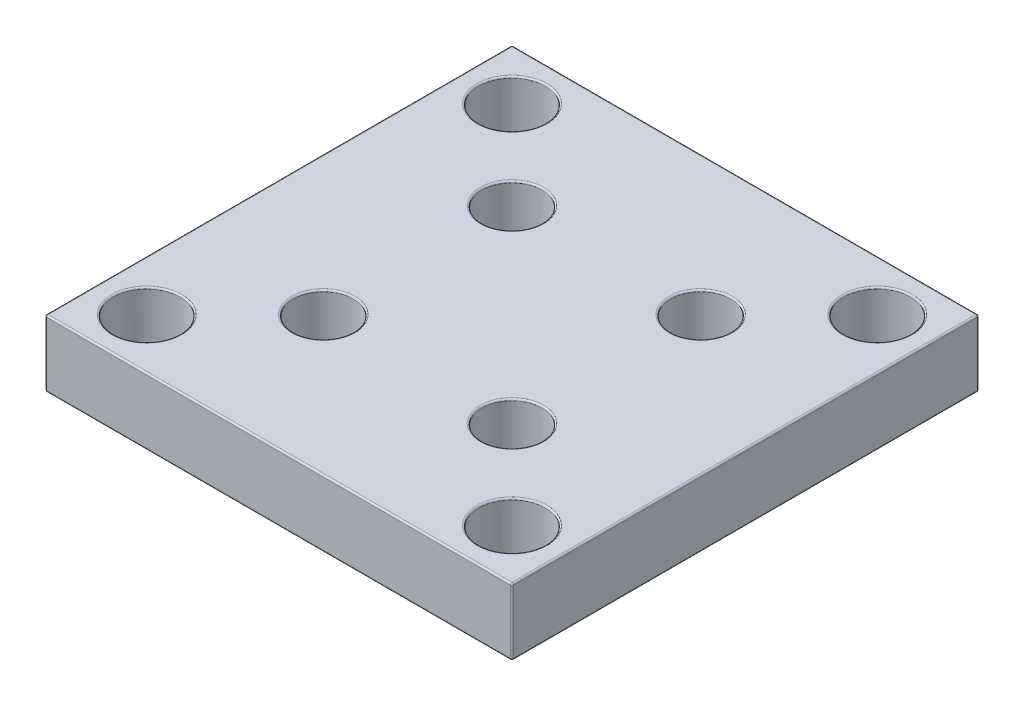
ISO-10303-21;
HEADER;
FILE_DESCRIPTION(('STEP AP214'),'2;1');
FILE_NAME('part.step','',(''),(''),'','','');
FILE_SCHEMA(('AUTOMOTIVE_DESIGN { 1 0 10303 214 1 1 1 1 }'));
ENDSEC;
DATA;
#1=APPLICATION_CONTEXT('core data for automotive mechanical design processes');
#2=APPLICATION_PROTOCOL_DEFINITION('international standard','automotive_design',2000,#1);
#3=PRODUCT_CONTEXT('',#1,'mechanical');
#4=PRODUCT('Part','Part','',(#3));
#5=PRODUCT_RELATED_PRODUCT_CATEGORY('part','',(#4));
#6=PRODUCT_DEFINITION_FORMATION('','',#4);
#7=PRODUCT_DEFINITION_CONTEXT('part definition',#1,'design');
#8=PRODUCT_DEFINITION('design','',#6,#7);
#9=PRODUCT_DEFINITION_SHAPE('','',#8);
#10=(LENGTH_UNIT() NAMED_UNIT(*) SI_UNIT(.MILLI.,.METRE.));
#11=(NAMED_UNIT(*) PLANE_ANGLE_UNIT() SI_UNIT($,.RADIAN.));
#12=(NAMED_UNIT(*) SI_UNIT($,.STERADIAN.) SOLID_ANGLE_UNIT());
#13=UNCERTAINTY_MEASURE_WITH_UNIT(LENGTH_MEASURE(1.E-05),#10,'distance_accuracy_value','');
#14=(GEOMETRIC_REPRESENTATION_CONTEXT(3) GLOBAL_UNCERTAINTY_ASSIGNED_CONTEXT((#13)) GLOBAL_UNIT_ASSIGNED_CONTEXT((#10,
#11,#12)) REPRESENTATION_CONTEXT('',''));
#15=CARTESIAN_POINT('',(0.,0.,0.));
#16=DIRECTION('',(0.,0.,1.));
#17=DIRECTION('',(1.,0.,0.));
#18=AXIS2_PLACEMENT_3D('',#15,#16,#17);
#19=CARTESIAN_POINT('',(41.7157287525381,0.,-41.7157287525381));
#20=DIRECTION('',(0.,1.,0.));
#21=DIRECTION('',(0.,0.,1.));
#22=AXIS2_PLACEMENT_3D('',#19,#20,#21);
#23=CYLINDRICAL_SURFACE('',#22,5.5);
#24=CARTESIAN_POINT('',(41.7157287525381,0.5,-41.7157287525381));
#25=DIRECTION('',(0.,-1.,0.));
#26=DIRECTION('',(0.,0.,-1.));
#27=AXIS2_PLACEMENT_3D('',#24,#25,#26);
#28=CIRCLE('',#27,5.5);
#29=CARTESIAN_POINT('',(41.7157287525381,0.5,-47.2157287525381));
#30=VERTEX_POINT('',#29);
#31=EDGE_CURVE('E246',#30,#30,#28,.T.);
#32=ORIENTED_EDGE('',*,*,#31,.T.);
#33=EDGE_LOOP('',(#32));
#34=FACE_BOUND('',#33,.T.);
#35=CARTESIAN_POINT('',(41.7157287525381,5.,-41.7157287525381));
#36=DIRECTION('',(0.,1.,0.));
#37=DIRECTION('',(0.,0.,1.));
#38=AXIS2_PLACEMENT_3D('',#35,#36,#37);
#39=CIRCLE('',#38,5.5);
#40=CARTESIAN_POINT('',(41.7157287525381,5.,-36.2157287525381));
#41=VERTEX_POINT('',#40);
#42=EDGE_CURVE('E182',#41,#41,#39,.F.);
#43=ORIENTED_EDGE('',*,*,#42,.F.);
#44=EDGE_LOOP('',(#43));
#45=FACE_BOUND('',#44,.T.);
#46=ADVANCED_FACE('F43',(#34,#45),#23,.F.);
#47=CARTESIAN_POINT('',(98.2842712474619,0.,-41.7157287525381));
#48=DIRECTION('',(0.,1.,0.));
#49=DIRECTION('',(0.,0.,1.));
#50=AXIS2_PLACEMENT_3D('',#47,#48,#49);
#51=CYLINDRICAL_SURFACE('',#50,5.49999999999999);
#52=CARTESIAN_POINT('',(98.2842712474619,0.5,-41.7157287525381));
#53=DIRECTION('',(0.,-1.,0.));
#54=DIRECTION('',(0.,0.,-1.));
#55=AXIS2_PLACEMENT_3D('',#52,#53,#54);
#56=CIRCLE('',#55,5.49999999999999);
#57=CARTESIAN_POINT('',(98.2842712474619,0.5,-47.2157287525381));
#58=VERTEX_POINT('',#57);
#59=EDGE_CURVE('E242',#58,#58,#56,.T.);
#60=ORIENTED_EDGE('',*,*,#59,.T.);
#61=EDGE_LOOP('',(#60));
#62=FACE_BOUND('',#61,.T.);
#63=CARTESIAN_POINT('',(98.2842712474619,5.,-41.7157287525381));
#64=DIRECTION('',(0.,1.,0.));
#65=DIRECTION('',(0.,0.,1.));
#66=AXIS2_PLACEMENT_3D('',#63,#64,#65);
#67=CIRCLE('',#66,5.49999999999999);
#68=CARTESIAN_POINT('',(98.2842712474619,5.,-36.2157287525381));
#69=VERTEX_POINT('',#68);
#70=EDGE_CURVE('E465',#69,#69,#67,.F.);
#71=ORIENTED_EDGE('',*,*,#70,.F.);
#72=EDGE_LOOP('',(#71));
#73=FACE_BOUND('',#72,.T.);
#74=ADVANCED_FACE('F513',(#62,#73),#51,.F.);
#75=CARTESIAN_POINT('',(98.2842712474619,0.,-98.2842712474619));
#76=DIRECTION('',(0.,1.,0.));
#77=DIRECTION('',(0.,0.,1.));
#78=AXIS2_PLACEMENT_3D('',#75,#76,#77);
#79=CYLINDRICAL_SURFACE('',#78,5.49999999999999);
#80=CARTESIAN_POINT('',(98.2842712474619,0.5,-98.2842712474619));
#81=DIRECTION('',(0.,-1.,0.));
#82=DIRECTION('',(0.,0.,-1.));
#83=AXIS2_PLACEMENT_3D('',#80,#81,#82);
#84=CIRCLE('',#83,5.49999999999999);
#85=CARTESIAN_POINT('',(98.2842712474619,0.5,-103.784271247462));
#86=VERTEX_POINT('',#85);
#87=EDGE_CURVE('E222',#86,#86,#84,.T.);
#88=ORIENTED_EDGE('',*,*,#87,.T.);
#89=EDGE_LOOP('',(#88));
#90=FACE_BOUND('',#89,.T.);
#91=CARTESIAN_POINT('',(98.2842712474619,5.,-98.2842712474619));
#92=DIRECTION('',(0.,1.,0.));
#93=DIRECTION('',(0.,0.,1.));
#94=AXIS2_PLACEMENT_3D('',#91,#92,#93);
#95=CIRCLE('',#94,5.49999999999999);
#96=CARTESIAN_POINT('',(98.2842712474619,5.,-92.784271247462));
#97=VERTEX_POINT('',#96);
#98=EDGE_CURVE('E470',#97,#97,#95,.F.);
#99=ORIENTED_EDGE('',*,*,#98,.F.);
#100=EDGE_LOOP('',(#99));
#101=FACE_BOUND('',#100,.T.);
#102=ADVANCED_FACE('F515',(#90,#101),#79,.F.);
#103=CARTESIAN_POINT('',(41.7157287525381,0.,-98.2842712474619));
#104=DIRECTION('',(0.,1.,0.));
#105=DIRECTION('',(0.,0.,1.));
#106=AXIS2_PLACEMENT_3D('',#103,#104,#105);
#107=CYLINDRICAL_SURFACE('',#106,5.5);
#108=CARTESIAN_POINT('',(41.7157287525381,0.5,-98.2842712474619));
#109=DIRECTION('',(0.,-1.,0.));
#110=DIRECTION('',(0.,0.,-1.));
#111=AXIS2_PLACEMENT_3D('',#108,#109,#110);
#112=CIRCLE('',#111,5.5);
#113=CARTESIAN_POINT('',(41.7157287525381,0.5,-103.784271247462));
#114=VERTEX_POINT('',#113);
#115=EDGE_CURVE('E226',#114,#114,#112,.T.);
#116=ORIENTED_EDGE('',*,*,#115,.T.);
#117=EDGE_LOOP('',(#116));
#118=FACE_BOUND('',#117,.T.);
#119=CARTESIAN_POINT('',(41.7157287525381,5.,-98.2842712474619));
#120=DIRECTION('',(0.,1.,0.));
#121=DIRECTION('',(0.,0.,1.));
#122=AXIS2_PLACEMENT_3D('',#119,#120,#121);
#123=CIRCLE('',#122,5.5);
#124=CARTESIAN_POINT('',(41.7157287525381,5.,-92.7842712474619));
#125=VERTEX_POINT('',#124);
#126=EDGE_CURVE('E475',#125,#125,#123,.F.);
#127=ORIENTED_EDGE('',*,*,#126,.F.);
#128=EDGE_LOOP('',(#127));
#129=FACE_BOUND('',#128,.T.);
#130=ADVANCED_FACE('F522',(#118,#129),#107,.F.);
#131=CARTESIAN_POINT('',(124.75,0.,-124.75));
#132=DIRECTION('',(0.,1.,0.));
#133=DIRECTION('',(0.,0.,1.));
#134=AXIS2_PLACEMENT_3D('',#131,#132,#133);
#135=CYLINDRICAL_SURFACE('',#134,6.75);
#136=CARTESIAN_POINT('',(124.75,0.5,-124.75));
#137=DIRECTION('',(0.,-1.,0.));
#138=DIRECTION('',(0.,0.,-1.));
#139=AXIS2_PLACEMENT_3D('',#136,#137,#138);
#140=CIRCLE('',#139,6.75);
#141=CARTESIAN_POINT('',(124.75,0.5,-131.5));
#142=VERTEX_POINT('',#141);
#143=EDGE_CURVE('E234',#142,#142,#140,.T.);
#144=ORIENTED_EDGE('',*,*,#143,.T.);
#145=EDGE_LOOP('',(#144));
#146=FACE_BOUND('',#145,.T.);
#147=CARTESIAN_POINT('',(124.75,5.,-124.75));
#148=DIRECTION('',(0.,1.,0.));
#149=DIRECTION('',(0.,0.,1.));
#150=AXIS2_PLACEMENT_3D('',#147,#148,#149);
#151=CIRCLE('',#150,6.75);
#152=CARTESIAN_POINT('',(124.75,5.,-118.));
#153=VERTEX_POINT('',#152);
#154=EDGE_CURVE('E479',#153,#153,#151,.F.);
#155=ORIENTED_EDGE('',*,*,#154,.F.);
#156=EDGE_LOOP('',(#155));
#157=FACE_BOUND('',#156,.T.);
#158=ADVANCED_FACE('F533',(#146,#157),#135,.F.);
#159=CARTESIAN_POINT('',(124.75,0.,-15.25));
#160=DIRECTION('',(0.,1.,0.));
#161=DIRECTION('',(0.,0.,1.));
#162=AXIS2_PLACEMENT_3D('',#159,#160,#161);
#163=CYLINDRICAL_SURFACE('',#162,6.75);
#164=CARTESIAN_POINT('',(124.75,0.5,-15.25));
#165=DIRECTION('',(0.,-1.,0.));
#166=DIRECTION('',(0.,0.,-1.));
#167=AXIS2_PLACEMENT_3D('',#164,#165,#166);
#168=CIRCLE('',#167,6.75);
#169=CARTESIAN_POINT('',(124.75,0.5,-22.));
#170=VERTEX_POINT('',#169);
#171=EDGE_CURVE('E238',#170,#170,#168,.T.);
#172=ORIENTED_EDGE('',*,*,#171,.T.);
#173=EDGE_LOOP('',(#172));
#174=FACE_BOUND('',#173,.T.);
#175=CARTESIAN_POINT('',(124.75,5.,-15.25));
#176=DIRECTION('',(0.,1.,0.));
#177=DIRECTION('',(0.,0.,1.));
#178=AXIS2_PLACEMENT_3D('',#175,#176,#177);
#179=CIRCLE('',#178,6.75);
#180=CARTESIAN_POINT('',(124.75,5.,-8.50000000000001));
#181=VERTEX_POINT('',#180);
#182=EDGE_CURVE('E484',#181,#181,#179,.F.);
#183=ORIENTED_EDGE('',*,*,#182,.F.);
#184=EDGE_LOOP('',(#183));
#185=FACE_BOUND('',#184,.T.);
#186=ADVANCED_FACE('F529',(#174,#185),#163,.F.);
#187=CARTESIAN_POINT('',(15.25,0.,-15.25));
#188=DIRECTION('',(0.,1.,0.));
#189=DIRECTION('',(0.,0.,1.));
#190=AXIS2_PLACEMENT_3D('',#187,#188,#189);
#191=CYLINDRICAL_SURFACE('',#190,6.75);
#192=CARTESIAN_POINT('',(15.25,0.5,-15.25));
#193=DIRECTION('',(0.,-1.,0.));
#194=DIRECTION('',(0.,0.,-1.));
#195=AXIS2_PLACEMENT_3D('',#192,#193,#194);
#196=CIRCLE('',#195,6.75);
#197=CARTESIAN_POINT('',(15.25,0.5,-22.));
#198=VERTEX_POINT('',#197);
#199=EDGE_CURVE('E250',#198,#198,#196,.T.);
#200=ORIENTED_EDGE('',*,*,#199,.T.);
#201=EDGE_LOOP('',(#200));
#202=FACE_BOUND('',#201,.T.);
#203=CARTESIAN_POINT('',(15.25,5.,-15.25));
#204=DIRECTION('',(0.,1.,0.));
#205=DIRECTION('',(0.,0.,1.));
#206=AXIS2_PLACEMENT_3D('',#203,#204,#205);
#207=CIRCLE('',#206,6.75);
#208=CARTESIAN_POINT('',(15.25,5.,-8.50000000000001));
#209=VERTEX_POINT('',#208);
#210=EDGE_CURVE('E489',#209,#209,#207,.F.);
#211=ORIENTED_EDGE('',*,*,#210,.F.);
#212=EDGE_LOOP('',(#211));
#213=FACE_BOUND('',#212,.T.);
#214=ADVANCED_FACE('F532',(#202,#213),#191,.F.);
#215=CARTESIAN_POINT('',(15.25,0.,-124.75));
#216=DIRECTION('',(0.,1.,0.));
#217=DIRECTION('',(0.,0.,1.));
#218=AXIS2_PLACEMENT_3D('',#215,#216,#217);
#219=CYLINDRICAL_SURFACE('',#218,6.75);
#220=CARTESIAN_POINT('',(15.25,0.5,-124.75));
#221=DIRECTION('',(0.,-1.,0.));
#222=DIRECTION('',(0.,0.,-1.));
#223=AXIS2_PLACEMENT_3D('',#220,#221,#222);
#224=CIRCLE('',#223,6.75);
#225=CARTESIAN_POINT('',(15.25,0.5,-131.5));
#226=VERTEX_POINT('',#225);
#227=EDGE_CURVE('E230',#226,#226,#224,.T.);
#228=ORIENTED_EDGE('',*,*,#227,.T.);
#229=EDGE_LOOP('',(#228));
#230=FACE_BOUND('',#229,.T.);
#231=CARTESIAN_POINT('',(15.25,5.,-124.75));
#232=DIRECTION('',(0.,1.,0.));
#233=DIRECTION('',(0.,0.,1.));
#234=AXIS2_PLACEMENT_3D('',#231,#232,#233);
#235=CIRCLE('',#234,6.75);
#236=CARTESIAN_POINT('',(15.25,5.,-118.));
#237=VERTEX_POINT('',#236);
#238=EDGE_CURVE('E173',#237,#237,#235,.F.);
#239=ORIENTED_EDGE('',*,*,#238,.F.);
#240=EDGE_LOOP('',(#239));
#241=FACE_BOUND('',#240,.T.);
#242=ADVANCED_FACE('F538',(#230,#241),#219,.F.);
#243=CARTESIAN_POINT('',(0.,20.,0.));
#244=DIRECTION('',(1.,0.,0.));
#245=DIRECTION('',(0.,0.,-1.));
#246=AXIS2_PLACEMENT_3D('',#243,#244,#245);
#247=PLANE('',#246);
#248=DIRECTION('',(0.,-1.,0.));
#249=VECTOR('',#248,1.);
#250=CARTESIAN_POINT('',(0.,20.,-139.5));
#251=LINE('',#250,#249);
#252=CARTESIAN_POINT('',(0.,19.5,-139.5));
#253=VERTEX_POINT('',#252);
#254=CARTESIAN_POINT('',(0.,0.5,-139.5));
#255=VERTEX_POINT('',#254);
#256=EDGE_CURVE('E260',#253,#255,#251,.T.);
#257=ORIENTED_EDGE('',*,*,#256,.T.);
#258=DIRECTION('',(0.,0.,1.));
#259=VECTOR('',#258,1.);
#260=CARTESIAN_POINT('',(0.,0.5,0.));
#261=LINE('',#260,#259);
#262=CARTESIAN_POINT('',(0.,0.5,-0.5));
#263=VERTEX_POINT('',#262);
#264=EDGE_CURVE('E263',#255,#263,#261,.T.);
#265=ORIENTED_EDGE('',*,*,#264,.T.);
#266=DIRECTION('',(0.,-1.,0.));
#267=VECTOR('',#266,1.);
#268=CARTESIAN_POINT('',(0.,20.,-0.5));
#269=LINE('',#268,#267);
#270=CARTESIAN_POINT('',(0.,19.5,-0.5));
#271=VERTEX_POINT('',#270);
#272=EDGE_CURVE('E257',#263,#271,#269,.F.);
#273=ORIENTED_EDGE('',*,*,#272,.T.);
#274=DIRECTION('',(0.,0.,1.));
#275=VECTOR('',#274,1.);
#276=CARTESIAN_POINT('',(0.,19.5,0.));
#277=LINE('',#276,#275);
#278=EDGE_CURVE('E254',#271,#253,#277,.F.);
#279=ORIENTED_EDGE('',*,*,#278,.T.);
#280=EDGE_LOOP('',(#257,#265,#273,#279));
#281=FACE_BOUND('',#280,.T.);
#282=ADVANCED_FACE('F541',(#281),#247,.F.);
#283=CARTESIAN_POINT('',(0.,20.,0.));
#284=DIRECTION('',(0.,0.,-1.));
#285=DIRECTION('',(-1.,0.,0.));
#286=AXIS2_PLACEMENT_3D('',#283,#284,#285);
#287=PLANE('',#286);
#288=DIRECTION('',(0.,-1.,0.));
#289=VECTOR('',#288,1.);
#290=CARTESIAN_POINT('',(0.5,20.,0.));
#291=LINE('',#290,#289);
#292=CARTESIAN_POINT('',(0.5,19.5,0.));
#293=VERTEX_POINT('',#292);
#294=CARTESIAN_POINT('',(0.5,0.5,0.));
#295=VERTEX_POINT('',#294);
#296=EDGE_CURVE('E298',#293,#295,#291,.T.);
#297=ORIENTED_EDGE('',*,*,#296,.T.);
#298=DIRECTION('',(1.,0.,0.));
#299=VECTOR('',#298,1.);
#300=CARTESIAN_POINT('',(140.,0.5,0.));
#301=LINE('',#300,#299);
#302=CARTESIAN_POINT('',(139.5,0.5,0.));
#303=VERTEX_POINT('',#302);
#304=EDGE_CURVE('E302',#295,#303,#301,.T.);
#305=ORIENTED_EDGE('',*,*,#304,.T.);
#306=DIRECTION('',(0.,-1.,0.));
#307=VECTOR('',#306,1.);
#308=CARTESIAN_POINT('',(139.5,20.,0.));
#309=LINE('',#308,#307);
#310=CARTESIAN_POINT('',(139.5,19.5,0.));
#311=VERTEX_POINT('',#310);
#312=EDGE_CURVE('E295',#303,#311,#309,.F.);
#313=ORIENTED_EDGE('',*,*,#312,.T.);
#314=DIRECTION('',(1.,0.,0.));
#315=VECTOR('',#314,1.);
#316=CARTESIAN_POINT('',(0.,19.5,0.));
#317=LINE('',#316,#315);
#318=EDGE_CURVE('E292',#311,#293,#317,.F.);
#319=ORIENTED_EDGE('',*,*,#318,.T.);
#320=EDGE_LOOP('',(#297,#305,#313,#319));
#321=FACE_BOUND('',#320,.T.);
#322=ADVANCED_FACE('F560',(#321),#287,.F.);
#323=CARTESIAN_POINT('',(140.,20.,0.));
#324=DIRECTION('',(-1.,0.,0.));
#325=DIRECTION('',(0.,0.,1.));
#326=AXIS2_PLACEMENT_3D('',#323,#324,#325);
#327=PLANE('',#326);
#328=DIRECTION('',(0.,0.,-1.));
#329=VECTOR('',#328,1.);
#330=CARTESIAN_POINT('',(140.,0.5,-140.));
#331=LINE('',#330,#329);
#332=CARTESIAN_POINT('',(140.,0.5,-0.5));
#333=VERTEX_POINT('',#332);
#334=CARTESIAN_POINT('',(140.,0.5,-139.5));
#335=VERTEX_POINT('',#334);
#336=EDGE_CURVE('E152',#333,#335,#331,.T.);
#337=ORIENTED_EDGE('',*,*,#336,.T.);
#338=DIRECTION('',(0.,-1.,0.));
#339=VECTOR('',#338,1.);
#340=CARTESIAN_POINT('',(140.,20.,-139.5));
#341=LINE('',#340,#339);
#342=CARTESIAN_POINT('',(140.,19.5,-139.5));
#343=VERTEX_POINT('',#342);
#344=EDGE_CURVE('E288',#335,#343,#341,.F.);
#345=ORIENTED_EDGE('',*,*,#344,.T.);
#346=DIRECTION('',(0.,0.,-1.));
#347=VECTOR('',#346,1.);
#348=CARTESIAN_POINT('',(140.,19.5,0.));
#349=LINE('',#348,#347);
#350=CARTESIAN_POINT('',(140.,19.5,-0.5));
#351=VERTEX_POINT('',#350);
#352=EDGE_CURVE('E280',#343,#351,#349,.F.);
#353=ORIENTED_EDGE('',*,*,#352,.T.);
#354=DIRECTION('',(0.,-1.,0.));
#355=VECTOR('',#354,1.);
#356=CARTESIAN_POINT('',(140.,20.,-0.5));
#357=LINE('',#356,#355);
#358=EDGE_CURVE('E283',#351,#333,#357,.T.);
#359=ORIENTED_EDGE('',*,*,#358,.T.);
#360=EDGE_LOOP('',(#337,#345,#353,#359));
#361=FACE_BOUND('',#360,.T.);
#362=ADVANCED_FACE('F556',(#361),#327,.F.);
#363=CARTESIAN_POINT('',(0.,20.,-140.));
#364=DIRECTION('',(0.,0.,1.));
#365=DIRECTION('',(1.,0.,0.));
#366=AXIS2_PLACEMENT_3D('',#363,#364,#365);
#367=PLANE('',#366);
#368=DIRECTION('',(-1.,0.,0.));
#369=VECTOR('',#368,1.);
#370=CARTESIAN_POINT('',(0.,0.5,-140.));
#371=LINE('',#370,#369);
#372=CARTESIAN_POINT('',(139.5,0.5,-140.));
#373=VERTEX_POINT('',#372);
#374=CARTESIAN_POINT('',(0.5,0.5,-140.));
#375=VERTEX_POINT('',#374);
#376=EDGE_CURVE('E273',#373,#375,#371,.T.);
#377=ORIENTED_EDGE('',*,*,#376,.T.);
#378=DIRECTION('',(0.,-1.,0.));
#379=VECTOR('',#378,1.);
#380=CARTESIAN_POINT('',(0.5,20.,-140.));
#381=LINE('',#380,#379);
#382=CARTESIAN_POINT('',(0.5,19.5,-140.));
#383=VERTEX_POINT('',#382);
#384=EDGE_CURVE('E276',#375,#383,#381,.F.);
#385=ORIENTED_EDGE('',*,*,#384,.T.);
#386=DIRECTION('',(-1.,0.,0.));
#387=VECTOR('',#386,1.);
#388=CARTESIAN_POINT('',(0.,19.5,-140.));
#389=LINE('',#388,#387);
#390=CARTESIAN_POINT('',(139.5,19.5,-140.));
#391=VERTEX_POINT('',#390);
#392=EDGE_CURVE('E267',#383,#391,#389,.F.);
#393=ORIENTED_EDGE('',*,*,#392,.T.);
#394=DIRECTION('',(0.,-1.,0.));
#395=VECTOR('',#394,1.);
#396=CARTESIAN_POINT('',(139.5,20.,-140.));
#397=LINE('',#396,#395);
#398=EDGE_CURVE('E270',#391,#373,#397,.T.);
#399=ORIENTED_EDGE('',*,*,#398,.T.);
#400=EDGE_LOOP('',(#377,#385,#393,#399));
#401=FACE_BOUND('',#400,.T.);
#402=ADVANCED_FACE('F549',(#401),#367,.F.);
#403=CARTESIAN_POINT('',(0.,20.,-140.));
#404=DIRECTION('',(0.,-1.,0.));
#405=DIRECTION('',(0.,0.,-1.));
#406=AXIS2_PLACEMENT_3D('',#403,#404,#405);
#407=PLANE('',#406);
#408=DIRECTION('',(0.,0.,-1.));
#409=VECTOR('',#408,1.);
#410=CARTESIAN_POINT('',(139.5,20.,-140.));
#411=LINE('',#410,#409);
#412=CARTESIAN_POINT('',(139.5,20.,-0.5));
#413=VERTEX_POINT('',#412);
#414=CARTESIAN_POINT('',(139.5,20.,-139.5));
#415=VERTEX_POINT('',#414);
#416=EDGE_CURVE('E61',#413,#415,#411,.T.);
#417=ORIENTED_EDGE('',*,*,#416,.T.);
#418=DIRECTION('',(-1.,0.,0.));
#419=VECTOR('',#418,1.);
#420=CARTESIAN_POINT('',(0.,20.,-139.5));
#421=LINE('',#420,#419);
#422=CARTESIAN_POINT('',(0.5,20.,-139.5));
#423=VERTEX_POINT('',#422);
#424=EDGE_CURVE('E343',#415,#423,#421,.T.);
#425=ORIENTED_EDGE('',*,*,#424,.T.);
#426=DIRECTION('',(0.,0.,1.));
#427=VECTOR('',#426,1.);
#428=CARTESIAN_POINT('',(0.5,20.,-140.));
#429=LINE('',#428,#427);
#430=CARTESIAN_POINT('',(0.5,20.,-0.5));
#431=VERTEX_POINT('',#430);
#432=EDGE_CURVE('E337',#423,#431,#429,.T.);
#433=ORIENTED_EDGE('',*,*,#432,.T.);
#434=DIRECTION('',(1.,0.,0.));
#435=VECTOR('',#434,1.);
#436=CARTESIAN_POINT('',(0.,20.,-0.5));
#437=LINE('',#436,#435);
#438=EDGE_CURVE('E66',#431,#413,#437,.T.);
#439=ORIENTED_EDGE('',*,*,#438,.T.);
#440=EDGE_LOOP('',(#417,#425,#433,#439));
#441=FACE_BOUND('',#440,.T.);
#442=CARTESIAN_POINT('',(15.25,20.,-124.75));
#443=DIRECTION('',(0.,-1.,0.));
#444=DIRECTION('',(0.,0.,-1.));
#445=AXIS2_PLACEMENT_3D('',#442,#443,#444);
#446=CIRCLE('',#445,10.5);
#447=CARTESIAN_POINT('',(15.25,20.,-135.25));
#448=VERTEX_POINT('',#447);
#449=EDGE_CURVE('E333',#448,#448,#446,.T.);
#450=ORIENTED_EDGE('',*,*,#449,.T.);
#451=EDGE_LOOP('',(#450));
#452=FACE_BOUND('',#451,.T.);
#453=CARTESIAN_POINT('',(15.25,20.,-15.25));
#454=DIRECTION('',(0.,-1.,0.));
#455=DIRECTION('',(0.,0.,-1.));
#456=AXIS2_PLACEMENT_3D('',#453,#454,#455);
#457=CIRCLE('',#456,10.5);
#458=CARTESIAN_POINT('',(15.25,20.,-25.75));
#459=VERTEX_POINT('',#458);
#460=EDGE_CURVE('E329',#459,#459,#457,.T.);
#461=ORIENTED_EDGE('',*,*,#460,.T.);
#462=EDGE_LOOP('',(#461));
#463=FACE_BOUND('',#462,.T.);
#464=CARTESIAN_POINT('',(124.75,20.,-15.25));
#465=DIRECTION('',(0.,-1.,0.));
#466=DIRECTION('',(0.,0.,-1.));
#467=AXIS2_PLACEMENT_3D('',#464,#465,#466);
#468=CIRCLE('',#467,10.5);
#469=CARTESIAN_POINT('',(124.75,20.,-25.75));
#470=VERTEX_POINT('',#469);
#471=EDGE_CURVE('E325',#470,#470,#468,.T.);
#472=ORIENTED_EDGE('',*,*,#471,.T.);
#473=EDGE_LOOP('',(#472));
#474=FACE_BOUND('',#473,.T.);
#475=CARTESIAN_POINT('',(124.75,20.,-124.75));
#476=DIRECTION('',(0.,-1.,0.));
#477=DIRECTION('',(0.,0.,-1.));
#478=AXIS2_PLACEMENT_3D('',#475,#476,#477);
#479=CIRCLE('',#478,10.5);
#480=CARTESIAN_POINT('',(124.75,20.,-135.25));
#481=VERTEX_POINT('',#480);
#482=EDGE_CURVE('E321',#481,#481,#479,.T.);
#483=ORIENTED_EDGE('',*,*,#482,.T.);
#484=EDGE_LOOP('',(#483));
#485=FACE_BOUND('',#484,.T.);
#486=CARTESIAN_POINT('',(41.7157287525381,20.,-98.2842712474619));
#487=DIRECTION('',(0.,-1.,0.));
#488=DIRECTION('',(0.,0.,-1.));
#489=AXIS2_PLACEMENT_3D('',#486,#487,#488);
#490=CIRCLE('',#489,9.50000000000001);
#491=CARTESIAN_POINT('',(41.7157287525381,20.,-107.784271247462));
#492=VERTEX_POINT('',#491);
#493=EDGE_CURVE('E317',#492,#492,#490,.T.);
#494=ORIENTED_EDGE('',*,*,#493,.T.);
#495=EDGE_LOOP('',(#494));
#496=FACE_BOUND('',#495,.T.);
#497=CARTESIAN_POINT('',(98.2842712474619,20.,-98.2842712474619));
#498=DIRECTION('',(0.,-1.,0.));
#499=DIRECTION('',(0.,0.,-1.));
#500=AXIS2_PLACEMENT_3D('',#497,#498,#499);
#501=CIRCLE('',#500,9.49999999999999);
#502=CARTESIAN_POINT('',(98.2842712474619,20.,-107.784271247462));
#503=VERTEX_POINT('',#502);
#504=EDGE_CURVE('E313',#503,#503,#501,.T.);
#505=ORIENTED_EDGE('',*,*,#504,.T.);
#506=EDGE_LOOP('',(#505));
#507=FACE_BOUND('',#506,.T.);
#508=CARTESIAN_POINT('',(98.2842712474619,20.,-41.7157287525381));
#509=DIRECTION('',(0.,-1.,0.));
#510=DIRECTION('',(0.,0.,-1.));
#511=AXIS2_PLACEMENT_3D('',#508,#509,#510);
#512=CIRCLE('',#511,9.5);
#513=CARTESIAN_POINT('',(98.2842712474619,20.,-51.2157287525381));
#514=VERTEX_POINT('',#513);
#515=EDGE_CURVE('E309',#514,#514,#512,.T.);
#516=ORIENTED_EDGE('',*,*,#515,.T.);
#517=EDGE_LOOP('',(#516));
#518=FACE_BOUND('',#517,.T.);
#519=CARTESIAN_POINT('',(41.7157287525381,20.,-41.7157287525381));
#520=DIRECTION('',(0.,-1.,0.));
#521=DIRECTION('',(0.,0.,-1.));
#522=AXIS2_PLACEMENT_3D('',#519,#520,#521);
#523=CIRCLE('',#522,9.5);
#524=CARTESIAN_POINT('',(41.7157287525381,20.,-51.2157287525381));
#525=VERTEX_POINT('',#524);
#526=EDGE_CURVE('E305',#525,#525,#523,.T.);
#527=ORIENTED_EDGE('',*,*,#526,.T.);
#528=EDGE_LOOP('',(#527));
#529=FACE_BOUND('',#528,.T.);
#530=ADVANCED_FACE('F546',(#441,#452,#463,#474,#485,#496,#507,#518,#529),#407,.F.);
#531=CARTESIAN_POINT('',(0.,0.,-140.));
#532=DIRECTION('',(0.,-1.,0.));
#533=DIRECTION('',(0.,0.,-1.));
#534=AXIS2_PLACEMENT_3D('',#531,#532,#533);
#535=PLANE('',#534);
#536=CARTESIAN_POINT('',(98.2842712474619,0.,-98.2842712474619));
#537=DIRECTION('',(0.,-1.,0.));
#538=DIRECTION('',(0.,0.,-1.));
#539=AXIS2_PLACEMENT_3D('',#536,#537,#538);
#540=CIRCLE('',#539,5.99999999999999);
#541=CARTESIAN_POINT('',(98.2842712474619,0.,-104.284271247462));
#542=VERTEX_POINT('',#541);
#543=EDGE_CURVE('E218',#542,#542,#540,.F.);
#544=ORIENTED_EDGE('',*,*,#543,.T.);
#545=EDGE_LOOP('',(#544));
#546=FACE_BOUND('',#545,.T.);
#547=CARTESIAN_POINT('',(41.7157287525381,0.,-98.2842712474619));
#548=DIRECTION('',(0.,-1.,0.));
#549=DIRECTION('',(0.,0.,-1.));
#550=AXIS2_PLACEMENT_3D('',#547,#548,#549);
#551=CIRCLE('',#550,6.);
#552=CARTESIAN_POINT('',(41.7157287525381,0.,-104.284271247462));
#553=VERTEX_POINT('',#552);
#554=EDGE_CURVE('E214',#553,#553,#551,.F.);
#555=ORIENTED_EDGE('',*,*,#554,.T.);
#556=EDGE_LOOP('',(#555));
#557=FACE_BOUND('',#556,.T.);
#558=CARTESIAN_POINT('',(15.25,0.,-124.75));
#559=DIRECTION('',(0.,-1.,0.));
#560=DIRECTION('',(0.,0.,-1.));
#561=AXIS2_PLACEMENT_3D('',#558,#559,#560);
#562=CIRCLE('',#561,7.25);
#563=CARTESIAN_POINT('',(15.25,0.,-132.));
#564=VERTEX_POINT('',#563);
#565=EDGE_CURVE('E210',#564,#564,#562,.F.);
#566=ORIENTED_EDGE('',*,*,#565,.T.);
#567=EDGE_LOOP('',(#566));
#568=FACE_BOUND('',#567,.T.);
#569=CARTESIAN_POINT('',(124.75,0.,-124.75));
#570=DIRECTION('',(0.,-1.,0.));
#571=DIRECTION('',(0.,0.,-1.));
#572=AXIS2_PLACEMENT_3D('',#569,#570,#571);
#573=CIRCLE('',#572,7.25);
#574=CARTESIAN_POINT('',(124.75,0.,-132.));
#575=VERTEX_POINT('',#574);
#576=EDGE_CURVE('E206',#575,#575,#573,.F.);
#577=ORIENTED_EDGE('',*,*,#576,.T.);
#578=EDGE_LOOP('',(#577));
#579=FACE_BOUND('',#578,.T.);
#580=CARTESIAN_POINT('',(124.75,0.,-15.25));
#581=DIRECTION('',(0.,-1.,0.));
#582=DIRECTION('',(0.,0.,-1.));
#583=AXIS2_PLACEMENT_3D('',#580,#581,#582);
#584=CIRCLE('',#583,7.25);
#585=CARTESIAN_POINT('',(124.75,0.,-22.5));
#586=VERTEX_POINT('',#585);
#587=EDGE_CURVE('E202',#586,#586,#584,.F.);
#588=ORIENTED_EDGE('',*,*,#587,.T.);
#589=EDGE_LOOP('',(#588));
#590=FACE_BOUND('',#589,.T.);
#591=CARTESIAN_POINT('',(98.2842712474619,0.,-41.7157287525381));
#592=DIRECTION('',(0.,-1.,0.));
#593=DIRECTION('',(0.,0.,-1.));
#594=AXIS2_PLACEMENT_3D('',#591,#592,#593);
#595=CIRCLE('',#594,5.99999999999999);
#596=CARTESIAN_POINT('',(98.2842712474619,0.,-47.7157287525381));
#597=VERTEX_POINT('',#596);
#598=EDGE_CURVE('E198',#597,#597,#595,.F.);
#599=ORIENTED_EDGE('',*,*,#598,.T.);
#600=EDGE_LOOP('',(#599));
#601=FACE_BOUND('',#600,.T.);
#602=CARTESIAN_POINT('',(41.7157287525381,0.,-41.7157287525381));
#603=DIRECTION('',(0.,-1.,0.));
#604=DIRECTION('',(0.,0.,-1.));
#605=AXIS2_PLACEMENT_3D('',#602,#603,#604);
#606=CIRCLE('',#605,6.);
#607=CARTESIAN_POINT('',(41.7157287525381,0.,-47.7157287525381));
#608=VERTEX_POINT('',#607);
#609=EDGE_CURVE('E194',#608,#608,#606,.F.);
#610=ORIENTED_EDGE('',*,*,#609,.T.);
#611=EDGE_LOOP('',(#610));
#612=FACE_BOUND('',#611,.T.);
#613=CARTESIAN_POINT('',(15.25,0.,-15.25));
#614=DIRECTION('',(0.,-1.,0.));
#615=DIRECTION('',(0.,0.,-1.));
#616=AXIS2_PLACEMENT_3D('',#613,#614,#615);
#617=CIRCLE('',#616,7.25);
#618=CARTESIAN_POINT('',(15.25,0.,-22.5));
#619=VERTEX_POINT('',#618);
#620=EDGE_CURVE('E190',#619,#619,#617,.F.);
#621=ORIENTED_EDGE('',*,*,#620,.T.);
#622=EDGE_LOOP('',(#621));
#623=FACE_BOUND('',#622,.T.);
#624=DIRECTION('',(1.,0.,0.));
#625=VECTOR('',#624,1.);
#626=CARTESIAN_POINT('',(0.,0.,-0.5));
#627=LINE('',#626,#625);
#628=CARTESIAN_POINT('',(139.5,0.,-0.5));
#629=VERTEX_POINT('',#628);
#630=CARTESIAN_POINT('',(0.5,0.,-0.5));
#631=VERTEX_POINT('',#630);
#632=EDGE_CURVE('E138',#629,#631,#627,.F.);
#633=ORIENTED_EDGE('',*,*,#632,.T.);
#634=DIRECTION('',(0.,0.,1.));
#635=VECTOR('',#634,1.);
#636=CARTESIAN_POINT('',(0.5,0.,-140.));
#637=LINE('',#636,#635);
#638=CARTESIAN_POINT('',(0.5,0.,-139.5));
#639=VERTEX_POINT('',#638);
#640=EDGE_CURVE('E187',#631,#639,#637,.F.);
#641=ORIENTED_EDGE('',*,*,#640,.T.);
#642=DIRECTION('',(-1.,0.,0.));
#643=VECTOR('',#642,1.);
#644=CARTESIAN_POINT('',(140.,0.,-139.5));
#645=LINE('',#644,#643);
#646=CARTESIAN_POINT('',(139.5,0.,-139.5));
#647=VERTEX_POINT('',#646);
#648=EDGE_CURVE('E141',#639,#647,#645,.F.);
#649=ORIENTED_EDGE('',*,*,#648,.T.);
#650=DIRECTION('',(0.,0.,-1.));
#651=VECTOR('',#650,1.);
#652=CARTESIAN_POINT('',(139.5,0.,0.));
#653=LINE('',#652,#651);
#654=EDGE_CURVE('E133',#647,#629,#653,.F.);
#655=ORIENTED_EDGE('',*,*,#654,.T.);
#656=EDGE_LOOP('',(#633,#641,#649,#655));
#657=FACE_BOUND('',#656,.T.);
#658=ADVANCED_FACE('F135',(#546,#557,#568,#579,#590,#601,#612,#623,#657),#535,.T.);
#659=CARTESIAN_POINT('',(15.25,5.,-124.75));
#660=DIRECTION('',(0.,1.,0.));
#661=DIRECTION('',(0.,0.,1.));
#662=AXIS2_PLACEMENT_3D('',#659,#660,#661);
#663=PLANE('',#662);
#664=CARTESIAN_POINT('',(15.25,5.,-124.75));
#665=DIRECTION('',(0.,1.,0.));
#666=DIRECTION('',(0.,0.,1.));
#667=AXIS2_PLACEMENT_3D('',#664,#665,#666);
#668=CIRCLE('',#667,10.);
#669=CARTESIAN_POINT('',(15.25,5.,-114.75));
#670=VERTEX_POINT('',#669);
#671=EDGE_CURVE('E179',#670,#670,#668,.T.);
#672=ORIENTED_EDGE('',*,*,#671,.T.);
#673=EDGE_LOOP('',(#672));
#674=FACE_BOUND('',#673,.T.);
#675=ORIENTED_EDGE('',*,*,#238,.T.);
#676=EDGE_LOOP('',(#675));
#677=FACE_BOUND('',#676,.T.);
#678=ADVANCED_FACE('F552',(#674,#677),#663,.T.);
#679=CARTESIAN_POINT('',(15.25,5.,-124.75));
#680=DIRECTION('',(0.,1.,0.));
#681=DIRECTION('',(0.,0.,1.));
#682=AXIS2_PLACEMENT_3D('',#679,#680,#681);
#683=CYLINDRICAL_SURFACE('',#682,10.);
#684=CARTESIAN_POINT('',(15.25,19.5,-124.75));
#685=DIRECTION('',(0.,-1.,0.));
#686=DIRECTION('',(0.,0.,-1.));
#687=AXIS2_PLACEMENT_3D('',#684,#685,#686);
#688=CIRCLE('',#687,10.);
#689=CARTESIAN_POINT('',(15.25,19.5,-134.75));
#690=VERTEX_POINT('',#689);
#691=EDGE_CURVE('E346',#690,#690,#688,.F.);
#692=ORIENTED_EDGE('',*,*,#691,.T.);
#693=EDGE_LOOP('',(#692));
#694=FACE_BOUND('',#693,.T.);
#695=ORIENTED_EDGE('',*,*,#671,.F.);
#696=EDGE_LOOP('',(#695));
#697=FACE_BOUND('',#696,.T.);
#698=ADVANCED_FACE('F757',(#694,#697),#683,.F.);
#699=CARTESIAN_POINT('',(15.25,5.,-15.25));
#700=DIRECTION('',(0.,1.,0.));
#701=DIRECTION('',(0.,0.,1.));
#702=AXIS2_PLACEMENT_3D('',#699,#700,#701);
#703=PLANE('',#702);
#704=CARTESIAN_POINT('',(15.25,5.,-15.25));
#705=DIRECTION('',(0.,1.,0.));
#706=DIRECTION('',(0.,0.,1.));
#707=AXIS2_PLACEMENT_3D('',#704,#705,#706);
#708=CIRCLE('',#707,10.);
#709=CARTESIAN_POINT('',(15.25,5.,-5.25000000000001));
#710=VERTEX_POINT('',#709);
#711=EDGE_CURVE('E485',#710,#710,#708,.T.);
#712=ORIENTED_EDGE('',*,*,#711,.T.);
#713=EDGE_LOOP('',(#712));
#714=FACE_BOUND('',#713,.T.);
#715=ORIENTED_EDGE('',*,*,#210,.T.);
#716=EDGE_LOOP('',(#715));
#717=FACE_BOUND('',#716,.T.);
#718=ADVANCED_FACE('F754',(#714,#717),#703,.T.);
#719=CARTESIAN_POINT('',(15.25,5.,-15.25));
#720=DIRECTION('',(0.,1.,0.));
#721=DIRECTION('',(0.,0.,1.));
#722=AXIS2_PLACEMENT_3D('',#719,#720,#721);
#723=CYLINDRICAL_SURFACE('',#722,10.);
#724=CARTESIAN_POINT('',(15.25,19.5,-15.25));
#725=DIRECTION('',(0.,-1.,0.));
#726=DIRECTION('',(0.,0.,-1.));
#727=AXIS2_PLACEMENT_3D('',#724,#725,#726);
#728=CIRCLE('',#727,10.);
#729=CARTESIAN_POINT('',(15.25,19.5,-25.25));
#730=VERTEX_POINT('',#729);
#731=EDGE_CURVE('E350',#730,#730,#728,.F.);
#732=ORIENTED_EDGE('',*,*,#731,.T.);
#733=EDGE_LOOP('',(#732));
#734=FACE_BOUND('',#733,.T.);
#735=ORIENTED_EDGE('',*,*,#711,.F.);
#736=EDGE_LOOP('',(#735));
#737=FACE_BOUND('',#736,.T.);
#738=ADVANCED_FACE('F749',(#734,#737),#723,.F.);
#739=CARTESIAN_POINT('',(124.75,5.,-15.25));
#740=DIRECTION('',(0.,1.,0.));
#741=DIRECTION('',(0.,0.,1.));
#742=AXIS2_PLACEMENT_3D('',#739,#740,#741);
#743=PLANE('',#742);
#744=CARTESIAN_POINT('',(124.75,5.,-15.25));
#745=DIRECTION('',(0.,1.,0.));
#746=DIRECTION('',(0.,0.,1.));
#747=AXIS2_PLACEMENT_3D('',#744,#745,#746);
#748=CIRCLE('',#747,9.99999999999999);
#749=CARTESIAN_POINT('',(124.75,5.,-5.25000000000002));
#750=VERTEX_POINT('',#749);
#751=EDGE_CURVE('E480',#750,#750,#748,.T.);
#752=ORIENTED_EDGE('',*,*,#751,.T.);
#753=EDGE_LOOP('',(#752));
#754=FACE_BOUND('',#753,.T.);
#755=ORIENTED_EDGE('',*,*,#182,.T.);
#756=EDGE_LOOP('',(#755));
#757=FACE_BOUND('',#756,.T.);
#758=ADVANCED_FACE('F746',(#754,#757),#743,.T.);
#759=CARTESIAN_POINT('',(124.75,5.,-15.25));
#760=DIRECTION('',(0.,1.,0.));
#761=DIRECTION('',(0.,0.,1.));
#762=AXIS2_PLACEMENT_3D('',#759,#760,#761);
#763=CYLINDRICAL_SURFACE('',#762,9.99999999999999);
#764=CARTESIAN_POINT('',(124.75,19.5,-15.25));
#765=DIRECTION('',(0.,-1.,0.));
#766=DIRECTION('',(0.,0.,-1.));
#767=AXIS2_PLACEMENT_3D('',#764,#765,#766);
#768=CIRCLE('',#767,9.99999999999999);
#769=CARTESIAN_POINT('',(124.75,19.5,-25.25));
#770=VERTEX_POINT('',#769);
#771=EDGE_CURVE('E354',#770,#770,#768,.F.);
#772=ORIENTED_EDGE('',*,*,#771,.T.);
#773=EDGE_LOOP('',(#772));
#774=FACE_BOUND('',#773,.T.);
#775=ORIENTED_EDGE('',*,*,#751,.F.);
#776=EDGE_LOOP('',(#775));
#777=FACE_BOUND('',#776,.T.);
#778=ADVANCED_FACE('F741',(#774,#777),#763,.F.);
#779=CARTESIAN_POINT('',(124.75,5.,-124.75));
#780=DIRECTION('',(0.,1.,0.));
#781=DIRECTION('',(0.,0.,1.));
#782=AXIS2_PLACEMENT_3D('',#779,#780,#781);
#783=PLANE('',#782);
#784=CARTESIAN_POINT('',(124.75,5.,-124.75));
#785=DIRECTION('',(0.,1.,0.));
#786=DIRECTION('',(0.,0.,1.));
#787=AXIS2_PLACEMENT_3D('',#784,#785,#786);
#788=CIRCLE('',#787,9.99999999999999);
#789=CARTESIAN_POINT('',(124.75,5.,-114.75));
#790=VERTEX_POINT('',#789);
#791=EDGE_CURVE('E476',#790,#790,#788,.T.);
#792=ORIENTED_EDGE('',*,*,#791,.T.);
#793=EDGE_LOOP('',(#792));
#794=FACE_BOUND('',#793,.T.);
#795=ORIENTED_EDGE('',*,*,#154,.T.);
#796=EDGE_LOOP('',(#795));
#797=FACE_BOUND('',#796,.T.);
#798=ADVANCED_FACE('F738',(#794,#797),#783,.T.);
#799=CARTESIAN_POINT('',(124.75,5.,-124.75));
#800=DIRECTION('',(0.,1.,0.));
#801=DIRECTION('',(0.,0.,1.));
#802=AXIS2_PLACEMENT_3D('',#799,#800,#801);
#803=CYLINDRICAL_SURFACE('',#802,9.99999999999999);
#804=CARTESIAN_POINT('',(124.75,19.5,-124.75));
#805=DIRECTION('',(0.,-1.,0.));
#806=DIRECTION('',(0.,0.,-1.));
#807=AXIS2_PLACEMENT_3D('',#804,#805,#806);
#808=CIRCLE('',#807,9.99999999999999);
#809=CARTESIAN_POINT('',(124.75,19.5,-134.75));
#810=VERTEX_POINT('',#809);
#811=EDGE_CURVE('E358',#810,#810,#808,.F.);
#812=ORIENTED_EDGE('',*,*,#811,.T.);
#813=EDGE_LOOP('',(#812));
#814=FACE_BOUND('',#813,.T.);
#815=ORIENTED_EDGE('',*,*,#791,.F.);
#816=EDGE_LOOP('',(#815));
#817=FACE_BOUND('',#816,.T.);
#818=ADVANCED_FACE('F733',(#814,#817),#803,.F.);
#819=CARTESIAN_POINT('',(41.7157287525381,5.,-98.2842712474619));
#820=DIRECTION('',(0.,1.,0.));
#821=DIRECTION('',(0.,0.,1.));
#822=AXIS2_PLACEMENT_3D('',#819,#820,#821);
#823=PLANE('',#822);
#824=CARTESIAN_POINT('',(41.7157287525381,5.,-98.2842712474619));
#825=DIRECTION('',(0.,1.,0.));
#826=DIRECTION('',(0.,0.,1.));
#827=AXIS2_PLACEMENT_3D('',#824,#825,#826);
#828=CIRCLE('',#827,9.00000000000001);
#829=CARTESIAN_POINT('',(41.7157287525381,5.,-89.2842712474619));
#830=VERTEX_POINT('',#829);
#831=EDGE_CURVE('E471',#830,#830,#828,.T.);
#832=ORIENTED_EDGE('',*,*,#831,.T.);
#833=EDGE_LOOP('',(#832));
#834=FACE_BOUND('',#833,.T.);
#835=ORIENTED_EDGE('',*,*,#126,.T.);
#836=EDGE_LOOP('',(#835));
#837=FACE_BOUND('',#836,.T.);
#838=ADVANCED_FACE('F730',(#834,#837),#823,.T.);
#839=CARTESIAN_POINT('',(41.7157287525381,5.,-98.2842712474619));
#840=DIRECTION('',(0.,1.,0.));
#841=DIRECTION('',(0.,0.,1.));
#842=AXIS2_PLACEMENT_3D('',#839,#840,#841);
#843=CYLINDRICAL_SURFACE('',#842,9.00000000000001);
#844=CARTESIAN_POINT('',(41.7157287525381,19.5,-98.2842712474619));
#845=DIRECTION('',(0.,-1.,0.));
#846=DIRECTION('',(0.,0.,-1.));
#847=AXIS2_PLACEMENT_3D('',#844,#845,#846);
#848=CIRCLE('',#847,9.00000000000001);
#849=CARTESIAN_POINT('',(41.7157287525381,19.5,-107.284271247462));
#850=VERTEX_POINT('',#849);
#851=EDGE_CURVE('E362',#850,#850,#848,.F.);
#852=ORIENTED_EDGE('',*,*,#851,.T.);
#853=EDGE_LOOP('',(#852));
#854=FACE_BOUND('',#853,.T.);
#855=ORIENTED_EDGE('',*,*,#831,.F.);
#856=EDGE_LOOP('',(#855));
#857=FACE_BOUND('',#856,.T.);
#858=ADVANCED_FACE('F727',(#854,#857),#843,.F.);
#859=CARTESIAN_POINT('',(98.2842712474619,5.,-98.2842712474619));
#860=DIRECTION('',(0.,1.,0.));
#861=DIRECTION('',(0.,0.,1.));
#862=AXIS2_PLACEMENT_3D('',#859,#860,#861);
#863=PLANE('',#862);
#864=CARTESIAN_POINT('',(98.2842712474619,5.,-98.2842712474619));
#865=DIRECTION('',(0.,1.,0.));
#866=DIRECTION('',(0.,0.,1.));
#867=AXIS2_PLACEMENT_3D('',#864,#865,#866);
#868=CIRCLE('',#867,8.99999999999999);
#869=CARTESIAN_POINT('',(98.2842712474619,5.,-89.284271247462));
#870=VERTEX_POINT('',#869);
#871=EDGE_CURVE('E466',#870,#870,#868,.T.);
#872=ORIENTED_EDGE('',*,*,#871,.T.);
#873=EDGE_LOOP('',(#872));
#874=FACE_BOUND('',#873,.T.);
#875=ORIENTED_EDGE('',*,*,#98,.T.);
#876=EDGE_LOOP('',(#875));
#877=FACE_BOUND('',#876,.T.);
#878=ADVANCED_FACE('F720',(#874,#877),#863,.T.);
#879=CARTESIAN_POINT('',(98.2842712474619,5.,-98.2842712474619));
#880=DIRECTION('',(0.,1.,0.));
#881=DIRECTION('',(0.,0.,1.));
#882=AXIS2_PLACEMENT_3D('',#879,#880,#881);
#883=CYLINDRICAL_SURFACE('',#882,8.99999999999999);
#884=CARTESIAN_POINT('',(98.2842712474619,19.5,-98.2842712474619));
#885=DIRECTION('',(0.,-1.,0.));
#886=DIRECTION('',(0.,0.,-1.));
#887=AXIS2_PLACEMENT_3D('',#884,#885,#886);
#888=CIRCLE('',#887,8.99999999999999);
#889=CARTESIAN_POINT('',(98.2842712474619,19.5,-107.284271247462));
#890=VERTEX_POINT('',#889);
#891=EDGE_CURVE('E366',#890,#890,#888,.F.);
#892=ORIENTED_EDGE('',*,*,#891,.T.);
#893=EDGE_LOOP('',(#892));
#894=FACE_BOUND('',#893,.T.);
#895=ORIENTED_EDGE('',*,*,#871,.F.);
#896=EDGE_LOOP('',(#895));
#897=FACE_BOUND('',#896,.T.);
#898=ADVANCED_FACE('F715',(#894,#897),#883,.F.);
#899=CARTESIAN_POINT('',(98.2842712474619,5.,-41.7157287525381));
#900=DIRECTION('',(0.,1.,0.));
#901=DIRECTION('',(0.,0.,1.));
#902=AXIS2_PLACEMENT_3D('',#899,#900,#901);
#903=PLANE('',#902);
#904=CARTESIAN_POINT('',(98.2842712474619,5.,-41.7157287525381));
#905=DIRECTION('',(0.,1.,0.));
#906=DIRECTION('',(0.,0.,1.));
#907=AXIS2_PLACEMENT_3D('',#904,#905,#906);
#908=CIRCLE('',#907,9.);
#909=CARTESIAN_POINT('',(98.2842712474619,5.,-32.7157287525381));
#910=VERTEX_POINT('',#909);
#911=EDGE_CURVE('E460',#910,#910,#908,.T.);
#912=ORIENTED_EDGE('',*,*,#911,.T.);
#913=EDGE_LOOP('',(#912));
#914=FACE_BOUND('',#913,.T.);
#915=ORIENTED_EDGE('',*,*,#70,.T.);
#916=EDGE_LOOP('',(#915));
#917=FACE_BOUND('',#916,.T.);
#918=ADVANCED_FACE('F511',(#914,#917),#903,.T.);
#919=CARTESIAN_POINT('',(98.2842712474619,5.,-41.7157287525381));
#920=DIRECTION('',(0.,1.,0.));
#921=DIRECTION('',(0.,0.,1.));
#922=AXIS2_PLACEMENT_3D('',#919,#920,#921);
#923=CYLINDRICAL_SURFACE('',#922,9.);
#924=CARTESIAN_POINT('',(98.2842712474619,19.5,-41.7157287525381));
#925=DIRECTION('',(0.,-1.,0.));
#926=DIRECTION('',(0.,0.,-1.));
#927=AXIS2_PLACEMENT_3D('',#924,#925,#926);
#928=CIRCLE('',#927,9.);
#929=CARTESIAN_POINT('',(98.2842712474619,19.5,-50.7157287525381));
#930=VERTEX_POINT('',#929);
#931=EDGE_CURVE('E53',#930,#930,#928,.F.);
#932=ORIENTED_EDGE('',*,*,#931,.T.);
#933=EDGE_LOOP('',(#932));
#934=FACE_BOUND('',#933,.T.);
#935=ORIENTED_EDGE('',*,*,#911,.F.);
#936=EDGE_LOOP('',(#935));
#937=FACE_BOUND('',#936,.T.);
#938=ADVANCED_FACE('F707',(#934,#937),#923,.F.);
#939=CARTESIAN_POINT('',(41.7157287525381,5.,-41.7157287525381));
#940=DIRECTION('',(0.,1.,0.));
#941=DIRECTION('',(0.,0.,1.));
#942=AXIS2_PLACEMENT_3D('',#939,#940,#941);
#943=PLANE('',#942);
#944=CARTESIAN_POINT('',(41.7157287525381,5.,-41.7157287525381));
#945=DIRECTION('',(0.,1.,0.));
#946=DIRECTION('',(0.,0.,1.));
#947=AXIS2_PLACEMENT_3D('',#944,#945,#946);
#948=CIRCLE('',#947,9.);
#949=CARTESIAN_POINT('',(41.7157287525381,5.,-32.7157287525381));
#950=VERTEX_POINT('',#949);
#951=EDGE_CURVE('E448',#950,#950,#948,.T.);
#952=ORIENTED_EDGE('',*,*,#951,.T.);
#953=EDGE_LOOP('',(#952));
#954=FACE_BOUND('',#953,.T.);
#955=ORIENTED_EDGE('',*,*,#42,.T.);
#956=EDGE_LOOP('',(#955));
#957=FACE_BOUND('',#956,.T.);
#958=ADVANCED_FACE('F710',(#954,#957),#943,.T.);
#959=CARTESIAN_POINT('',(41.7157287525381,5.,-41.7157287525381));
#960=DIRECTION('',(0.,1.,0.));
#961=DIRECTION('',(0.,0.,1.));
#962=AXIS2_PLACEMENT_3D('',#959,#960,#961);
#963=CYLINDRICAL_SURFACE('',#962,9.);
#964=CARTESIAN_POINT('',(41.7157287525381,19.5,-41.7157287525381));
#965=DIRECTION('',(0.,-1.,0.));
#966=DIRECTION('',(0.,0.,-1.));
#967=AXIS2_PLACEMENT_3D('',#964,#965,#966);
#968=CIRCLE('',#967,9.);
#969=CARTESIAN_POINT('',(41.7157287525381,19.5,-50.7157287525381));
#970=VERTEX_POINT('',#969);
#971=EDGE_CURVE('E11',#970,#970,#968,.F.);
#972=ORIENTED_EDGE('',*,*,#971,.T.);
#973=EDGE_LOOP('',(#972));
#974=FACE_BOUND('',#973,.T.);
#975=ORIENTED_EDGE('',*,*,#951,.F.);
#976=EDGE_LOOP('',(#975));
#977=FACE_BOUND('',#976,.T.);
#978=ADVANCED_FACE('F572',(#974,#977),#963,.F.);
#979=CARTESIAN_POINT('',(98.2842712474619,0.5,-98.2842712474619));
#980=DIRECTION('',(0.,-1.,0.));
#981=DIRECTION('',(0.,0.,-1.));
#982=AXIS2_PLACEMENT_3D('',#979,#980,#981);
#983=TOROIDAL_SURFACE('',#982,5.99999999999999,0.5);
#984=ORIENTED_EDGE('',*,*,#87,.F.);
#985=EDGE_LOOP('',(#984));
#986=FACE_BOUND('',#985,.T.);
#987=ORIENTED_EDGE('',*,*,#543,.F.);
#988=EDGE_LOOP('',(#987));
#989=FACE_BOUND('',#988,.T.);
#990=ADVANCED_FACE('F568',(#986,#989),#983,.T.);
#991=CARTESIAN_POINT('',(41.7157287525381,0.5,-98.2842712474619));
#992=DIRECTION('',(0.,-1.,0.));
#993=DIRECTION('',(0.,0.,-1.));
#994=AXIS2_PLACEMENT_3D('',#991,#992,#993);
#995=TOROIDAL_SURFACE('',#994,6.,0.5);
#996=ORIENTED_EDGE('',*,*,#115,.F.);
#997=EDGE_LOOP('',(#996));
#998=FACE_BOUND('',#997,.T.);
#999=ORIENTED_EDGE('',*,*,#554,.F.);
#1000=EDGE_LOOP('',(#999));
#1001=FACE_BOUND('',#1000,.T.);
#1002=ADVANCED_FACE('F571',(#998,#1001),#995,.T.);
#1003=CARTESIAN_POINT('',(15.25,0.5,-124.75));
#1004=DIRECTION('',(0.,-1.,0.));
#1005=DIRECTION('',(0.,0.,-1.));
#1006=AXIS2_PLACEMENT_3D('',#1003,#1004,#1005);
#1007=TOROIDAL_SURFACE('',#1006,7.25,0.5);
#1008=ORIENTED_EDGE('',*,*,#227,.F.);
#1009=EDGE_LOOP('',(#1008));
#1010=FACE_BOUND('',#1009,.T.);
#1011=ORIENTED_EDGE('',*,*,#565,.F.);
#1012=EDGE_LOOP('',(#1011));
#1013=FACE_BOUND('',#1012,.T.);
#1014=ADVANCED_FACE('F576',(#1010,#1013),#1007,.T.);
#1015=CARTESIAN_POINT('',(124.75,0.5,-124.75));
#1016=DIRECTION('',(0.,-1.,0.));
#1017=DIRECTION('',(0.,0.,-1.));
#1018=AXIS2_PLACEMENT_3D('',#1015,#1016,#1017);
#1019=TOROIDAL_SURFACE('',#1018,7.25,0.5);
#1020=ORIENTED_EDGE('',*,*,#143,.F.);
#1021=EDGE_LOOP('',(#1020));
#1022=FACE_BOUND('',#1021,.T.);
#1023=ORIENTED_EDGE('',*,*,#576,.F.);
#1024=EDGE_LOOP('',(#1023));
#1025=FACE_BOUND('',#1024,.T.);
#1026=ADVANCED_FACE('F580',(#1022,#1025),#1019,.T.);
#1027=CARTESIAN_POINT('',(124.75,0.5,-15.25));
#1028=DIRECTION('',(0.,-1.,0.));
#1029=DIRECTION('',(0.,0.,-1.));
#1030=AXIS2_PLACEMENT_3D('',#1027,#1028,#1029);
#1031=TOROIDAL_SURFACE('',#1030,7.25,0.5);
#1032=ORIENTED_EDGE('',*,*,#171,.F.);
#1033=EDGE_LOOP('',(#1032));
#1034=FACE_BOUND('',#1033,.T.);
#1035=ORIENTED_EDGE('',*,*,#587,.F.);
#1036=EDGE_LOOP('',(#1035));
#1037=FACE_BOUND('',#1036,.T.);
#1038=ADVANCED_FACE('F584',(#1034,#1037),#1031,.T.);
#1039=CARTESIAN_POINT('',(98.2842712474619,0.5,-41.7157287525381));
#1040=DIRECTION('',(0.,-1.,0.));
#1041=DIRECTION('',(0.,0.,-1.));
#1042=AXIS2_PLACEMENT_3D('',#1039,#1040,#1041);
#1043=TOROIDAL_SURFACE('',#1042,5.99999999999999,0.5);
#1044=ORIENTED_EDGE('',*,*,#59,.F.);
#1045=EDGE_LOOP('',(#1044));
#1046=FACE_BOUND('',#1045,.T.);
#1047=ORIENTED_EDGE('',*,*,#598,.F.);
#1048=EDGE_LOOP('',(#1047));
#1049=FACE_BOUND('',#1048,.T.);
#1050=ADVANCED_FACE('F588',(#1046,#1049),#1043,.T.);
#1051=CARTESIAN_POINT('',(41.7157287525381,0.5,-41.7157287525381));
#1052=DIRECTION('',(0.,-1.,0.));
#1053=DIRECTION('',(0.,0.,-1.));
#1054=AXIS2_PLACEMENT_3D('',#1051,#1052,#1053);
#1055=TOROIDAL_SURFACE('',#1054,6.,0.5);
#1056=ORIENTED_EDGE('',*,*,#31,.F.);
#1057=EDGE_LOOP('',(#1056));
#1058=FACE_BOUND('',#1057,.T.);
#1059=ORIENTED_EDGE('',*,*,#609,.F.);
#1060=EDGE_LOOP('',(#1059));
#1061=FACE_BOUND('',#1060,.T.);
#1062=ADVANCED_FACE('F592',(#1058,#1061),#1055,.T.);
#1063=CARTESIAN_POINT('',(15.25,0.5,-15.25));
#1064=DIRECTION('',(0.,-1.,0.));
#1065=DIRECTION('',(0.,0.,-1.));
#1066=AXIS2_PLACEMENT_3D('',#1063,#1064,#1065);
#1067=TOROIDAL_SURFACE('',#1066,7.25,0.5);
#1068=ORIENTED_EDGE('',*,*,#199,.F.);
#1069=EDGE_LOOP('',(#1068));
#1070=FACE_BOUND('',#1069,.T.);
#1071=ORIENTED_EDGE('',*,*,#620,.F.);
#1072=EDGE_LOOP('',(#1071));
#1073=FACE_BOUND('',#1072,.T.);
#1074=ADVANCED_FACE('F596',(#1070,#1073),#1067,.T.);
#1075=CARTESIAN_POINT('',(139.5,19.5,-140.));
#1076=DIRECTION('',(0.,0.,-1.));
#1077=DIRECTION('',(-1.,0.,0.));
#1078=AXIS2_PLACEMENT_3D('',#1075,#1076,#1077);
#1079=CYLINDRICAL_SURFACE('',#1078,0.5);
#1080=CARTESIAN_POINT('',(139.5,19.5,-139.5));
#1081=DIRECTION('',(0.,0.,-1.));
#1082=DIRECTION('',(-1.,0.,0.));
#1083=AXIS2_PLACEMENT_3D('',#1080,#1081,#1082);
#1084=CIRCLE('',#1083,0.5);
#1085=EDGE_CURVE('E47',#415,#343,#1084,.T.);
#1086=ORIENTED_EDGE('',*,*,#1085,.F.);
#1087=ORIENTED_EDGE('',*,*,#416,.F.);
#1088=CARTESIAN_POINT('',(139.5,19.5,-0.5));
#1089=DIRECTION('',(0.,0.,1.));
#1090=DIRECTION('',(0.,-1.,0.));
#1091=AXIS2_PLACEMENT_3D('',#1088,#1089,#1090);
#1092=CIRCLE('',#1091,0.5);
#1093=EDGE_CURVE('E439',#351,#413,#1092,.T.);
#1094=ORIENTED_EDGE('',*,*,#1093,.F.);
#1095=ORIENTED_EDGE('',*,*,#352,.F.);
#1096=EDGE_LOOP('',(#1086,#1087,#1094,#1095));
#1097=FACE_BOUND('',#1096,.T.);
#1098=ADVANCED_FACE('F600',(#1097),#1079,.T.);
#1099=CARTESIAN_POINT('',(139.5,19.5,-139.5));
#1100=DIRECTION('',(0.,0.,1.));
#1101=DIRECTION('',(1.,0.,0.));
#1102=AXIS2_PLACEMENT_3D('',#1099,#1100,#1101);
#1103=SPHERICAL_SURFACE('',#1102,0.5);
#1104=CARTESIAN_POINT('',(139.5,19.5,-139.5));
#1105=DIRECTION('',(1.,0.,0.));
#1106=DIRECTION('',(0.,0.,-1.));
#1107=AXIS2_PLACEMENT_3D('',#1104,#1105,#1106);
#1108=CIRCLE('',#1107,0.5);
#1109=EDGE_CURVE('E433',#415,#391,#1108,.F.);
#1110=ORIENTED_EDGE('',*,*,#1109,.F.);
#1111=ORIENTED_EDGE('',*,*,#1085,.T.);
#1112=CARTESIAN_POINT('',(139.5,19.5,-139.5));
#1113=DIRECTION('',(0.,1.,0.));
#1114=DIRECTION('',(0.,0.,1.));
#1115=AXIS2_PLACEMENT_3D('',#1112,#1113,#1114);
#1116=CIRCLE('',#1115,0.5);
#1117=EDGE_CURVE('E437',#391,#343,#1116,.F.);
#1118=ORIENTED_EDGE('',*,*,#1117,.F.);
#1119=EDGE_LOOP('',(#1110,#1111,#1118));
#1120=FACE_BOUND('',#1119,.T.);
#1121=ADVANCED_FACE('F668',(#1120),#1103,.T.);
#1122=CARTESIAN_POINT('',(139.5,19.5,-0.5));
#1123=DIRECTION('',(0.,0.,1.));
#1124=DIRECTION('',(1.,0.,0.));
#1125=AXIS2_PLACEMENT_3D('',#1122,#1123,#1124);
#1126=SPHERICAL_SURFACE('',#1125,0.5);
#1127=CARTESIAN_POINT('',(139.5,19.5,-0.5));
#1128=DIRECTION('',(0.,1.,0.));
#1129=DIRECTION('',(0.,0.,1.));
#1130=AXIS2_PLACEMENT_3D('',#1127,#1128,#1129);
#1131=CIRCLE('',#1130,0.5);
#1132=EDGE_CURVE('E425',#351,#311,#1131,.F.);
#1133=ORIENTED_EDGE('',*,*,#1132,.F.);
#1134=ORIENTED_EDGE('',*,*,#1093,.T.);
#1135=CARTESIAN_POINT('',(139.5,19.5,-0.5));
#1136=DIRECTION('',(1.,0.,0.));
#1137=DIRECTION('',(0.,0.,-1.));
#1138=AXIS2_PLACEMENT_3D('',#1135,#1136,#1137);
#1139=CIRCLE('',#1138,0.5);
#1140=EDGE_CURVE('E429',#311,#413,#1139,.F.);
#1141=ORIENTED_EDGE('',*,*,#1140,.F.);
#1142=EDGE_LOOP('',(#1133,#1134,#1141));
#1143=FACE_BOUND('',#1142,.T.);
#1144=ADVANCED_FACE('F664',(#1143),#1126,.T.);
#1145=CARTESIAN_POINT('',(139.5,20.,-139.5));
#1146=DIRECTION('',(0.,-1.,0.));
#1147=DIRECTION('',(0.,0.,-1.));
#1148=AXIS2_PLACEMENT_3D('',#1145,#1146,#1147);
#1149=CYLINDRICAL_SURFACE('',#1148,0.5);
#1150=ORIENTED_EDGE('',*,*,#1117,.T.);
#1151=ORIENTED_EDGE('',*,*,#344,.F.);
#1152=CARTESIAN_POINT('',(139.5,0.5,-139.5));
#1153=DIRECTION('',(0.,-1.,0.));
#1154=DIRECTION('',(0.,0.,-1.));
#1155=AXIS2_PLACEMENT_3D('',#1152,#1153,#1154);
#1156=CIRCLE('',#1155,0.5);
#1157=EDGE_CURVE('E418',#373,#335,#1156,.T.);
#1158=ORIENTED_EDGE('',*,*,#1157,.F.);
#1159=ORIENTED_EDGE('',*,*,#398,.F.);
#1160=EDGE_LOOP('',(#1150,#1151,#1158,#1159));
#1161=FACE_BOUND('',#1160,.T.);
#1162=ADVANCED_FACE('F660',(#1161),#1149,.T.);
#1163=CARTESIAN_POINT('',(0.,19.5,-139.5));
#1164=DIRECTION('',(-1.,0.,0.));
#1165=DIRECTION('',(0.,0.,1.));
#1166=AXIS2_PLACEMENT_3D('',#1163,#1164,#1165);
#1167=CYLINDRICAL_SURFACE('',#1166,0.5);
#1168=ORIENTED_EDGE('',*,*,#1109,.T.);
#1169=ORIENTED_EDGE('',*,*,#392,.F.);
#1170=CARTESIAN_POINT('',(0.5,19.5,-139.5));
#1171=DIRECTION('',(-1.,0.,0.));
#1172=DIRECTION('',(0.,0.,1.));
#1173=AXIS2_PLACEMENT_3D('',#1170,#1171,#1172);
#1174=CIRCLE('',#1173,0.5);
#1175=EDGE_CURVE('E414',#423,#383,#1174,.T.);
#1176=ORIENTED_EDGE('',*,*,#1175,.F.);
#1177=ORIENTED_EDGE('',*,*,#424,.F.);
#1178=EDGE_LOOP('',(#1168,#1169,#1176,#1177));
#1179=FACE_BOUND('',#1178,.T.);
#1180=ADVANCED_FACE('F656',(#1179),#1167,.T.);
#1181=CARTESIAN_POINT('',(0.5,19.5,-140.));
#1182=DIRECTION('',(0.,0.,1.));
#1183=DIRECTION('',(1.,0.,0.));
#1184=AXIS2_PLACEMENT_3D('',#1181,#1182,#1183);
#1185=CYLINDRICAL_SURFACE('',#1184,0.5);
#1186=CARTESIAN_POINT('',(0.5,19.5,-0.5));
#1187=DIRECTION('',(0.,0.,1.));
#1188=DIRECTION('',(1.,0.,0.));
#1189=AXIS2_PLACEMENT_3D('',#1186,#1187,#1188);
#1190=CIRCLE('',#1189,0.5);
#1191=EDGE_CURVE('E407',#431,#271,#1190,.T.);
#1192=ORIENTED_EDGE('',*,*,#1191,.F.);
#1193=ORIENTED_EDGE('',*,*,#432,.F.);
#1194=CARTESIAN_POINT('',(0.5,19.5,-139.5));
#1195=DIRECTION('',(0.,0.,-1.));
#1196=DIRECTION('',(-1.,0.,0.));
#1197=AXIS2_PLACEMENT_3D('',#1194,#1195,#1196);
#1198=CIRCLE('',#1197,0.5);
#1199=EDGE_CURVE('E411',#253,#423,#1198,.T.);
#1200=ORIENTED_EDGE('',*,*,#1199,.F.);
#1201=ORIENTED_EDGE('',*,*,#278,.F.);
#1202=EDGE_LOOP('',(#1192,#1193,#1200,#1201));
#1203=FACE_BOUND('',#1202,.T.);
#1204=ADVANCED_FACE('F652',(#1203),#1185,.T.);
#1205=CARTESIAN_POINT('',(0.,19.5,-0.5));
#1206=DIRECTION('',(1.,0.,0.));
#1207=DIRECTION('',(0.,0.,-1.));
#1208=AXIS2_PLACEMENT_3D('',#1205,#1206,#1207);
#1209=CYLINDRICAL_SURFACE('',#1208,0.5);
#1210=ORIENTED_EDGE('',*,*,#1140,.T.);
#1211=ORIENTED_EDGE('',*,*,#438,.F.);
#1212=CARTESIAN_POINT('',(0.5,19.5,-0.5));
#1213=DIRECTION('',(-1.,0.,0.));
#1214=DIRECTION('',(0.,0.,1.));
#1215=AXIS2_PLACEMENT_3D('',#1212,#1213,#1214);
#1216=CIRCLE('',#1215,0.5);
#1217=EDGE_CURVE('E403',#293,#431,#1216,.T.);
#1218=ORIENTED_EDGE('',*,*,#1217,.F.);
#1219=ORIENTED_EDGE('',*,*,#318,.F.);
#1220=EDGE_LOOP('',(#1210,#1211,#1218,#1219));
#1221=FACE_BOUND('',#1220,.T.);
#1222=ADVANCED_FACE('F648',(#1221),#1209,.T.);
#1223=CARTESIAN_POINT('',(139.5,20.,-0.5));
#1224=DIRECTION('',(0.,-1.,0.));
#1225=DIRECTION('',(0.,0.,-1.));
#1226=AXIS2_PLACEMENT_3D('',#1223,#1224,#1225);
#1227=CYLINDRICAL_SURFACE('',#1226,0.5);
#1228=ORIENTED_EDGE('',*,*,#1132,.T.);
#1229=ORIENTED_EDGE('',*,*,#312,.F.);
#1230=CARTESIAN_POINT('',(139.5,0.5,-0.5));
#1231=DIRECTION('',(0.,-1.,0.));
#1232=DIRECTION('',(0.,0.,-1.));
#1233=AXIS2_PLACEMENT_3D('',#1230,#1231,#1232);
#1234=CIRCLE('',#1233,0.5);
#1235=EDGE_CURVE('E157',#333,#303,#1234,.T.);
#1236=ORIENTED_EDGE('',*,*,#1235,.F.);
#1237=ORIENTED_EDGE('',*,*,#358,.F.);
#1238=EDGE_LOOP('',(#1228,#1229,#1236,#1237));
#1239=FACE_BOUND('',#1238,.T.);
#1240=ADVANCED_FACE('F645',(#1239),#1227,.T.);
#1241=CARTESIAN_POINT('',(139.5,0.5,0.));
#1242=DIRECTION('',(0.,0.,1.));
#1243=DIRECTION('',(1.,0.,0.));
#1244=AXIS2_PLACEMENT_3D('',#1241,#1242,#1243);
#1245=CYLINDRICAL_SURFACE('',#1244,0.5);
#1246=CARTESIAN_POINT('',(139.5,0.5,-139.5));
#1247=DIRECTION('',(0.,0.,-1.));
#1248=DIRECTION('',(-1.,0.,0.));
#1249=AXIS2_PLACEMENT_3D('',#1246,#1247,#1248);
#1250=CIRCLE('',#1249,0.5);
#1251=EDGE_CURVE('E422',#335,#647,#1250,.T.);
#1252=ORIENTED_EDGE('',*,*,#1251,.F.);
#1253=ORIENTED_EDGE('',*,*,#336,.F.);
#1254=CARTESIAN_POINT('',(139.5,0.5,-0.5));
#1255=DIRECTION('',(0.,0.,1.));
#1256=DIRECTION('',(1.,0.,0.));
#1257=AXIS2_PLACEMENT_3D('',#1254,#1255,#1256);
#1258=CIRCLE('',#1257,0.5);
#1259=EDGE_CURVE('E149',#629,#333,#1258,.T.);
#1260=ORIENTED_EDGE('',*,*,#1259,.F.);
#1261=ORIENTED_EDGE('',*,*,#654,.F.);
#1262=EDGE_LOOP('',(#1252,#1253,#1260,#1261));
#1263=FACE_BOUND('',#1262,.T.);
#1264=ADVANCED_FACE('F151',(#1263),#1245,.T.);
#1265=CARTESIAN_POINT('',(139.5,0.5,-139.5));
#1266=DIRECTION('',(0.,0.,1.));
#1267=DIRECTION('',(1.,0.,0.));
#1268=AXIS2_PLACEMENT_3D('',#1265,#1266,#1267);
#1269=SPHERICAL_SURFACE('',#1268,0.5);
#1270=ORIENTED_EDGE('',*,*,#1157,.T.);
#1271=ORIENTED_EDGE('',*,*,#1251,.T.);
#1272=CARTESIAN_POINT('',(139.5,0.5,-139.5));
#1273=DIRECTION('',(1.,0.,0.));
#1274=DIRECTION('',(0.,0.,-1.));
#1275=AXIS2_PLACEMENT_3D('',#1272,#1273,#1274);
#1276=CIRCLE('',#1275,0.5);
#1277=EDGE_CURVE('E158',#373,#647,#1276,.F.);
#1278=ORIENTED_EDGE('',*,*,#1277,.F.);
#1279=EDGE_LOOP('',(#1270,#1271,#1278));
#1280=FACE_BOUND('',#1279,.T.);
#1281=ADVANCED_FACE('F638',(#1280),#1269,.T.);
#1282=CARTESIAN_POINT('',(0.5,19.5,-139.5));
#1283=DIRECTION('',(0.,0.,1.));
#1284=DIRECTION('',(1.,0.,0.));
#1285=AXIS2_PLACEMENT_3D('',#1282,#1283,#1284);
#1286=SPHERICAL_SURFACE('',#1285,0.5);
#1287=ORIENTED_EDGE('',*,*,#1199,.T.);
#1288=ORIENTED_EDGE('',*,*,#1175,.T.);
#1289=CARTESIAN_POINT('',(0.5,19.5,-139.5));
#1290=DIRECTION('',(0.,1.,0.));
#1291=DIRECTION('',(0.,0.,1.));
#1292=AXIS2_PLACEMENT_3D('',#1289,#1290,#1291);
#1293=CIRCLE('',#1292,0.5);
#1294=EDGE_CURVE('E395',#253,#383,#1293,.F.);
#1295=ORIENTED_EDGE('',*,*,#1294,.F.);
#1296=EDGE_LOOP('',(#1287,#1288,#1295));
#1297=FACE_BOUND('',#1296,.T.);
#1298=ADVANCED_FACE('F634',(#1297),#1286,.T.);
#1299=CARTESIAN_POINT('',(0.5,19.5,-0.5));
#1300=DIRECTION('',(0.,0.,1.));
#1301=DIRECTION('',(1.,0.,0.));
#1302=AXIS2_PLACEMENT_3D('',#1299,#1300,#1301);
#1303=SPHERICAL_SURFACE('',#1302,0.5);
#1304=ORIENTED_EDGE('',*,*,#1217,.T.);
#1305=ORIENTED_EDGE('',*,*,#1191,.T.);
#1306=CARTESIAN_POINT('',(0.5,19.5,-0.5));
#1307=DIRECTION('',(0.,1.,0.));
#1308=DIRECTION('',(0.,0.,1.));
#1309=AXIS2_PLACEMENT_3D('',#1306,#1307,#1308);
#1310=CIRCLE('',#1309,0.5);
#1311=EDGE_CURVE('E166',#293,#271,#1310,.F.);
#1312=ORIENTED_EDGE('',*,*,#1311,.F.);
#1313=EDGE_LOOP('',(#1304,#1305,#1312));
#1314=FACE_BOUND('',#1313,.T.);
#1315=ADVANCED_FACE('F631',(#1314),#1303,.T.);
#1316=CARTESIAN_POINT('',(139.5,0.5,-0.5));
#1317=DIRECTION('',(0.,0.,1.));
#1318=DIRECTION('',(1.,0.,0.));
#1319=AXIS2_PLACEMENT_3D('',#1316,#1317,#1318);
#1320=SPHERICAL_SURFACE('',#1319,0.5);
#1321=ORIENTED_EDGE('',*,*,#1259,.T.);
#1322=ORIENTED_EDGE('',*,*,#1235,.T.);
#1323=CARTESIAN_POINT('',(139.5,0.5,-0.5));
#1324=DIRECTION('',(1.,0.,0.));
#1325=DIRECTION('',(0.,0.,-1.));
#1326=AXIS2_PLACEMENT_3D('',#1323,#1324,#1325);
#1327=CIRCLE('',#1326,0.5);
#1328=EDGE_CURVE('E161',#629,#303,#1327,.F.);
#1329=ORIENTED_EDGE('',*,*,#1328,.F.);
#1330=EDGE_LOOP('',(#1321,#1322,#1329));
#1331=FACE_BOUND('',#1330,.T.);
#1332=ADVANCED_FACE('F162',(#1331),#1320,.T.);
#1333=CARTESIAN_POINT('',(0.,0.5,-139.5));
#1334=DIRECTION('',(1.,0.,0.));
#1335=DIRECTION('',(0.,0.,-1.));
#1336=AXIS2_PLACEMENT_3D('',#1333,#1334,#1335);
#1337=CYLINDRICAL_SURFACE('',#1336,0.5);
#1338=ORIENTED_EDGE('',*,*,#1277,.T.);
#1339=ORIENTED_EDGE('',*,*,#648,.F.);
#1340=CARTESIAN_POINT('',(0.5,0.5,-139.5));
#1341=DIRECTION('',(-1.,0.,0.));
#1342=DIRECTION('',(0.,0.,1.));
#1343=AXIS2_PLACEMENT_3D('',#1340,#1341,#1342);
#1344=CIRCLE('',#1343,0.5);
#1345=EDGE_CURVE('E167',#375,#639,#1344,.T.);
#1346=ORIENTED_EDGE('',*,*,#1345,.F.);
#1347=ORIENTED_EDGE('',*,*,#376,.F.);
#1348=EDGE_LOOP('',(#1338,#1339,#1346,#1347));
#1349=FACE_BOUND('',#1348,.T.);
#1350=ADVANCED_FACE('F624',(#1349),#1337,.T.);
#1351=CARTESIAN_POINT('',(0.5,20.,-139.5));
#1352=DIRECTION('',(0.,-1.,0.));
#1353=DIRECTION('',(0.,0.,-1.));
#1354=AXIS2_PLACEMENT_3D('',#1351,#1352,#1353);
#1355=CYLINDRICAL_SURFACE('',#1354,0.5);
#1356=ORIENTED_EDGE('',*,*,#1294,.T.);
#1357=ORIENTED_EDGE('',*,*,#384,.F.);
#1358=CARTESIAN_POINT('',(0.5,0.5,-139.5));
#1359=DIRECTION('',(0.,-1.,0.));
#1360=DIRECTION('',(0.,0.,-1.));
#1361=AXIS2_PLACEMENT_3D('',#1358,#1359,#1360);
#1362=CIRCLE('',#1361,0.5);
#1363=EDGE_CURVE('E385',#255,#375,#1362,.T.);
#1364=ORIENTED_EDGE('',*,*,#1363,.F.);
#1365=ORIENTED_EDGE('',*,*,#256,.F.);
#1366=EDGE_LOOP('',(#1356,#1357,#1364,#1365));
#1367=FACE_BOUND('',#1366,.T.);
#1368=ADVANCED_FACE('F620',(#1367),#1355,.T.);
#1369=CARTESIAN_POINT('',(0.5,20.,-0.5));
#1370=DIRECTION('',(0.,-1.,0.));
#1371=DIRECTION('',(0.,0.,-1.));
#1372=AXIS2_PLACEMENT_3D('',#1369,#1370,#1371);
#1373=CYLINDRICAL_SURFACE('',#1372,0.5);
#1374=ORIENTED_EDGE('',*,*,#1311,.T.);
#1375=ORIENTED_EDGE('',*,*,#272,.F.);
#1376=CARTESIAN_POINT('',(0.5,0.5,-0.5));
#1377=DIRECTION('',(0.,-1.,0.));
#1378=DIRECTION('',(0.,0.,-1.));
#1379=AXIS2_PLACEMENT_3D('',#1376,#1377,#1378);
#1380=CIRCLE('',#1379,0.5);
#1381=EDGE_CURVE('E381',#295,#263,#1380,.T.);
#1382=ORIENTED_EDGE('',*,*,#1381,.F.);
#1383=ORIENTED_EDGE('',*,*,#296,.F.);
#1384=EDGE_LOOP('',(#1374,#1375,#1382,#1383));
#1385=FACE_BOUND('',#1384,.T.);
#1386=ADVANCED_FACE('F617',(#1385),#1373,.T.);
#1387=CARTESIAN_POINT('',(0.,0.5,-0.5));
#1388=DIRECTION('',(-1.,0.,0.));
#1389=DIRECTION('',(0.,0.,1.));
#1390=AXIS2_PLACEMENT_3D('',#1387,#1388,#1389);
#1391=CYLINDRICAL_SURFACE('',#1390,0.5);
#1392=ORIENTED_EDGE('',*,*,#1328,.T.);
#1393=ORIENTED_EDGE('',*,*,#304,.F.);
#1394=CARTESIAN_POINT('',(0.5,0.5,-0.5));
#1395=DIRECTION('',(-1.,0.,0.));
#1396=DIRECTION('',(0.,0.,1.));
#1397=AXIS2_PLACEMENT_3D('',#1394,#1395,#1396);
#1398=CIRCLE('',#1397,0.5);
#1399=EDGE_CURVE('E170',#631,#295,#1398,.T.);
#1400=ORIENTED_EDGE('',*,*,#1399,.F.);
#1401=ORIENTED_EDGE('',*,*,#632,.F.);
#1402=EDGE_LOOP('',(#1392,#1393,#1400,#1401));
#1403=FACE_BOUND('',#1402,.T.);
#1404=ADVANCED_FACE('F169',(#1403),#1391,.T.);
#1405=CARTESIAN_POINT('',(0.5,0.5,-139.5));
#1406=DIRECTION('',(0.,0.,1.));
#1407=DIRECTION('',(1.,0.,0.));
#1408=AXIS2_PLACEMENT_3D('',#1405,#1406,#1407);
#1409=SPHERICAL_SURFACE('',#1408,0.5);
#1410=ORIENTED_EDGE('',*,*,#1363,.T.);
#1411=ORIENTED_EDGE('',*,*,#1345,.T.);
#1412=CARTESIAN_POINT('',(0.5,0.5,-139.5));
#1413=DIRECTION('',(0.,0.,-1.));
#1414=DIRECTION('',(-1.,0.,0.));
#1415=AXIS2_PLACEMENT_3D('',#1412,#1413,#1414);
#1416=CIRCLE('',#1415,0.5);
#1417=EDGE_CURVE('E376',#255,#639,#1416,.F.);
#1418=ORIENTED_EDGE('',*,*,#1417,.F.);
#1419=EDGE_LOOP('',(#1410,#1411,#1418));
#1420=FACE_BOUND('',#1419,.T.);
#1421=ADVANCED_FACE('F610',(#1420),#1409,.T.);
#1422=CARTESIAN_POINT('',(0.5,0.5,-0.5));
#1423=DIRECTION('',(0.,0.,1.));
#1424=DIRECTION('',(1.,0.,0.));
#1425=AXIS2_PLACEMENT_3D('',#1422,#1423,#1424);
#1426=SPHERICAL_SURFACE('',#1425,0.5);
#1427=ORIENTED_EDGE('',*,*,#1399,.T.);
#1428=ORIENTED_EDGE('',*,*,#1381,.T.);
#1429=CARTESIAN_POINT('',(0.5,0.5,-0.5));
#1430=DIRECTION('',(0.,0.,1.));
#1431=DIRECTION('',(1.,0.,0.));
#1432=AXIS2_PLACEMENT_3D('',#1429,#1430,#1431);
#1433=CIRCLE('',#1432,0.5);
#1434=EDGE_CURVE('E373',#631,#263,#1433,.F.);
#1435=ORIENTED_EDGE('',*,*,#1434,.F.);
#1436=EDGE_LOOP('',(#1427,#1428,#1435));
#1437=FACE_BOUND('',#1436,.T.);
#1438=ADVANCED_FACE('F606',(#1437),#1426,.T.);
#1439=CARTESIAN_POINT('',(0.5,0.5,0.));
#1440=DIRECTION('',(0.,0.,-1.));
#1441=DIRECTION('',(-1.,0.,0.));
#1442=AXIS2_PLACEMENT_3D('',#1439,#1440,#1441);
#1443=CYLINDRICAL_SURFACE('',#1442,0.5);
#1444=ORIENTED_EDGE('',*,*,#1417,.T.);
#1445=ORIENTED_EDGE('',*,*,#640,.F.);
#1446=ORIENTED_EDGE('',*,*,#1434,.T.);
#1447=ORIENTED_EDGE('',*,*,#264,.F.);
#1448=EDGE_LOOP('',(#1444,#1445,#1446,#1447));
#1449=FACE_BOUND('',#1448,.T.);
#1450=ADVANCED_FACE('F602',(#1449),#1443,.T.);
#1451=CARTESIAN_POINT('',(15.25,19.5,-124.75));
#1452=DIRECTION('',(0.,-1.,0.));
#1453=DIRECTION('',(0.,0.,-1.));
#1454=AXIS2_PLACEMENT_3D('',#1451,#1452,#1453);
#1455=TOROIDAL_SURFACE('',#1454,10.5,0.5);
#1456=ORIENTED_EDGE('',*,*,#449,.F.);
#1457=EDGE_LOOP('',(#1456));
#1458=FACE_BOUND('',#1457,.T.);
#1459=ORIENTED_EDGE('',*,*,#691,.F.);
#1460=EDGE_LOOP('',(#1459));
#1461=FACE_BOUND('',#1460,.T.);
#1462=ADVANCED_FACE('F605',(#1458,#1461),#1455,.T.);
#1463=CARTESIAN_POINT('',(15.25,19.5,-15.25));
#1464=DIRECTION('',(0.,-1.,0.));
#1465=DIRECTION('',(0.,0.,-1.));
#1466=AXIS2_PLACEMENT_3D('',#1463,#1464,#1465);
#1467=TOROIDAL_SURFACE('',#1466,10.5,0.5);
#1468=ORIENTED_EDGE('',*,*,#460,.F.);
#1469=EDGE_LOOP('',(#1468));
#1470=FACE_BOUND('',#1469,.T.);
#1471=ORIENTED_EDGE('',*,*,#731,.F.);
#1472=EDGE_LOOP('',(#1471));
#1473=FACE_BOUND('',#1472,.T.);
#1474=ADVANCED_FACE('F676',(#1470,#1473),#1467,.T.);
#1475=CARTESIAN_POINT('',(124.75,19.5,-15.25));
#1476=DIRECTION('',(0.,-1.,0.));
#1477=DIRECTION('',(0.,0.,-1.));
#1478=AXIS2_PLACEMENT_3D('',#1475,#1476,#1477);
#1479=TOROIDAL_SURFACE('',#1478,10.5,0.5);
#1480=ORIENTED_EDGE('',*,*,#471,.F.);
#1481=EDGE_LOOP('',(#1480));
#1482=FACE_BOUND('',#1481,.T.);
#1483=ORIENTED_EDGE('',*,*,#771,.F.);
#1484=EDGE_LOOP('',(#1483));
#1485=FACE_BOUND('',#1484,.T.);
#1486=ADVANCED_FACE('F680',(#1482,#1485),#1479,.T.);
#1487=CARTESIAN_POINT('',(124.75,19.5,-124.75));
#1488=DIRECTION('',(0.,-1.,0.));
#1489=DIRECTION('',(0.,0.,-1.));
#1490=AXIS2_PLACEMENT_3D('',#1487,#1488,#1489);
#1491=TOROIDAL_SURFACE('',#1490,10.5,0.5);
#1492=ORIENTED_EDGE('',*,*,#482,.F.);
#1493=EDGE_LOOP('',(#1492));
#1494=FACE_BOUND('',#1493,.T.);
#1495=ORIENTED_EDGE('',*,*,#811,.F.);
#1496=EDGE_LOOP('',(#1495));
#1497=FACE_BOUND('',#1496,.T.);
#1498=ADVANCED_FACE('F684',(#1494,#1497),#1491,.T.);
#1499=CARTESIAN_POINT('',(41.7157287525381,19.5,-98.2842712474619));
#1500=DIRECTION('',(0.,-1.,0.));
#1501=DIRECTION('',(0.,0.,-1.));
#1502=AXIS2_PLACEMENT_3D('',#1499,#1500,#1501);
#1503=TOROIDAL_SURFACE('',#1502,9.50000000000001,0.5);
#1504=ORIENTED_EDGE('',*,*,#493,.F.);
#1505=EDGE_LOOP('',(#1504));
#1506=FACE_BOUND('',#1505,.T.);
#1507=ORIENTED_EDGE('',*,*,#851,.F.);
#1508=EDGE_LOOP('',(#1507));
#1509=FACE_BOUND('',#1508,.T.);
#1510=ADVANCED_FACE('F688',(#1506,#1509),#1503,.T.);
#1511=CARTESIAN_POINT('',(98.2842712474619,19.5,-98.2842712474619));
#1512=DIRECTION('',(0.,-1.,0.));
#1513=DIRECTION('',(0.,0.,-1.));
#1514=AXIS2_PLACEMENT_3D('',#1511,#1512,#1513);
#1515=TOROIDAL_SURFACE('',#1514,9.49999999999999,0.5);
#1516=ORIENTED_EDGE('',*,*,#504,.F.);
#1517=EDGE_LOOP('',(#1516));
#1518=FACE_BOUND('',#1517,.T.);
#1519=ORIENTED_EDGE('',*,*,#891,.F.);
#1520=EDGE_LOOP('',(#1519));
#1521=FACE_BOUND('',#1520,.T.);
#1522=ADVANCED_FACE('F692',(#1518,#1521),#1515,.T.);
#1523=CARTESIAN_POINT('',(98.2842712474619,19.5,-41.7157287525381));
#1524=DIRECTION('',(0.,-1.,0.));
#1525=DIRECTION('',(0.,0.,-1.));
#1526=AXIS2_PLACEMENT_3D('',#1523,#1524,#1525);
#1527=TOROIDAL_SURFACE('',#1526,9.5,0.5);
#1528=ORIENTED_EDGE('',*,*,#515,.F.);
#1529=EDGE_LOOP('',(#1528));
#1530=FACE_BOUND('',#1529,.T.);
#1531=ORIENTED_EDGE('',*,*,#931,.F.);
#1532=EDGE_LOOP('',(#1531));
#1533=FACE_BOUND('',#1532,.T.);
#1534=ADVANCED_FACE('F695',(#1530,#1533),#1527,.T.);
#1535=CARTESIAN_POINT('',(41.7157287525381,19.5,-41.7157287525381));
#1536=DIRECTION('',(0.,-1.,0.));
#1537=DIRECTION('',(0.,0.,-1.));
#1538=AXIS2_PLACEMENT_3D('',#1535,#1536,#1537);
#1539=TOROIDAL_SURFACE('',#1538,9.5,0.5);
#1540=ORIENTED_EDGE('',*,*,#526,.F.);
#1541=EDGE_LOOP('',(#1540));
#1542=FACE_BOUND('',#1541,.T.);
#1543=ORIENTED_EDGE('',*,*,#971,.F.);
#1544=EDGE_LOOP('',(#1543));
#1545=FACE_BOUND('',#1544,.T.);
#1546=ADVANCED_FACE('F45',(#1542,#1545),#1539,.T.);
#1547=CLOSED_SHELL('',(#46,#74,#102,#130,#158,#186,#214,#242,#282,#322,#362,#402,#530,#658,#678,
#698,#718,#738,#758,#778,#798,#818,#838,#858,#878,#898,#918,#938,#958,#978,#990,#1002,#1014,
#1026,#1038,#1050,#1062,#1074,#1098,#1121,#1144,#1162,#1180,#1204,#1222,#1240,#1264,#1281,#1298,
#1315,#1332,#1350,#1368,#1386,#1404,#1421,#1438,#1450,#1462,#1474,#1486,#1498,#1510,#1522,#1534,#1546));
#1548=MANIFOLD_SOLID_BREP('B2',#1547);
#1549=ADVANCED_BREP_SHAPE_REPRESENTATION('',(#18,#1548),#14);
#1550=SHAPE_DEFINITION_REPRESENTATION(#9,#1549);
ENDSEC;
END-ISO-10303-21;
